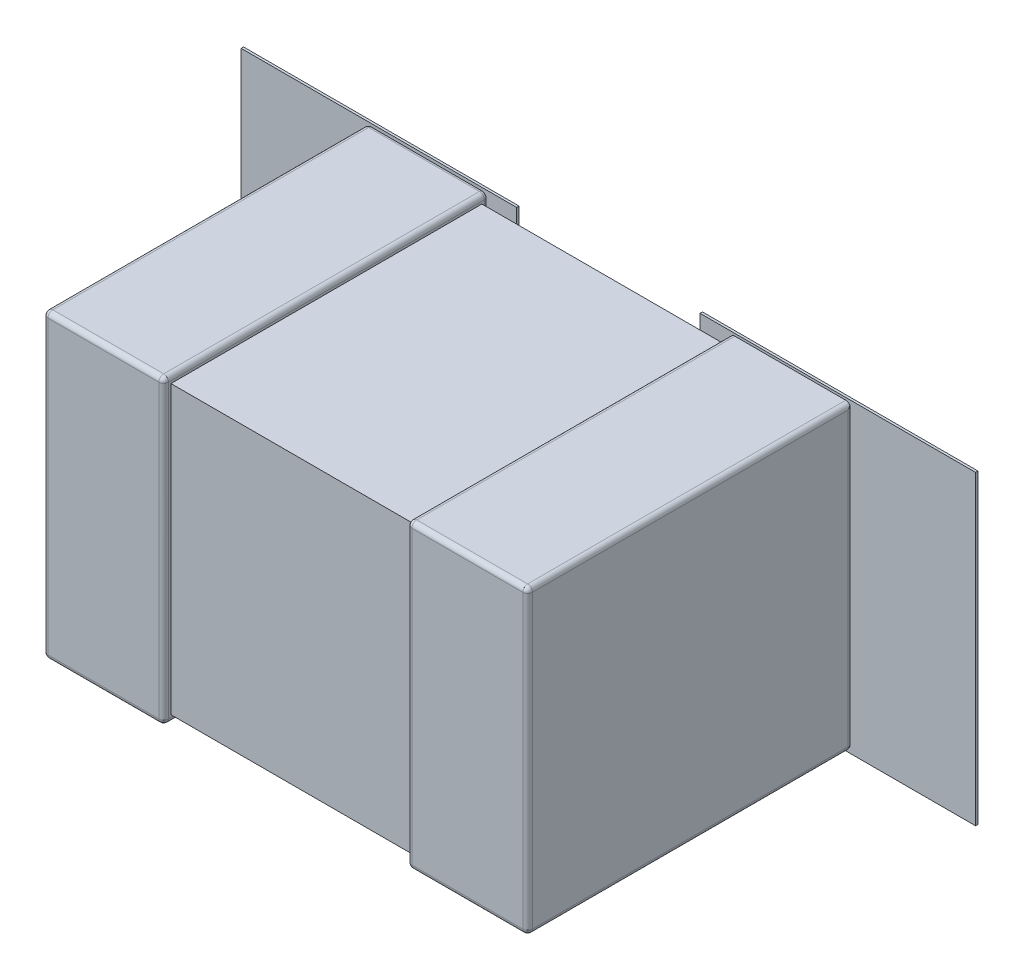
ISO-10303-21;
HEADER;
FILE_DESCRIPTION(('STEP AP214'),'2;1');
FILE_NAME('part.step','',(''),(''),'','','');
FILE_SCHEMA(('AUTOMOTIVE_DESIGN { 1 0 10303 214 1 1 1 1 }'));
ENDSEC;
DATA;
#1=APPLICATION_CONTEXT('core data for automotive mechanical design processes');
#2=APPLICATION_PROTOCOL_DEFINITION('international standard','automotive_design',2000,#1);
#3=PRODUCT_CONTEXT('',#1,'mechanical');
#4=PRODUCT('Part','Part','',(#3));
#5=PRODUCT_RELATED_PRODUCT_CATEGORY('part','',(#4));
#6=PRODUCT_DEFINITION_FORMATION('','',#4);
#7=PRODUCT_DEFINITION_CONTEXT('part definition',#1,'design');
#8=PRODUCT_DEFINITION('design','',#6,#7);
#9=PRODUCT_DEFINITION_SHAPE('','',#8);
#10=(LENGTH_UNIT() NAMED_UNIT(*) SI_UNIT(.MILLI.,.METRE.));
#11=(NAMED_UNIT(*) PLANE_ANGLE_UNIT() SI_UNIT($,.RADIAN.));
#12=(NAMED_UNIT(*) SI_UNIT($,.STERADIAN.) SOLID_ANGLE_UNIT());
#13=UNCERTAINTY_MEASURE_WITH_UNIT(LENGTH_MEASURE(1.E-05),#10,'distance_accuracy_value','');
#14=(GEOMETRIC_REPRESENTATION_CONTEXT(3) GLOBAL_UNCERTAINTY_ASSIGNED_CONTEXT((#13)) GLOBAL_UNIT_ASSIGNED_CONTEXT((#10,
#11,#12)) REPRESENTATION_CONTEXT('',''));
#15=CARTESIAN_POINT('',(0.,0.,0.));
#16=DIRECTION('',(0.,0.,1.));
#17=DIRECTION('',(1.,0.,0.));
#18=AXIS2_PLACEMENT_3D('',#15,#16,#17);
#19=CARTESIAN_POINT('',(0.,0.,0.0762));
#20=DIRECTION('',(0.,0.,1.));
#21=DIRECTION('',(1.,0.,0.));
#22=AXIS2_PLACEMENT_3D('',#19,#20,#21);
#23=PLANE('',#22);
#24=DIRECTION('',(1.,0.,0.));
#25=VECTOR('',#24,1.);
#26=CARTESIAN_POINT('',(-1.5235,-0.635,0.0762));
#27=LINE('',#26,#25);
#28=CARTESIAN_POINT('',(-1.5235,-0.635,0.0762));
#29=VERTEX_POINT('',#28);
#30=CARTESIAN_POINT('',(-0.380500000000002,-0.635,0.0762));
#31=VERTEX_POINT('',#30);
#32=EDGE_CURVE('E917',#29,#31,#27,.T.);
#33=ORIENTED_EDGE('',*,*,#32,.F.);
#34=DIRECTION('',(0.,1.,0.));
#35=VECTOR('',#34,1.);
#36=CARTESIAN_POINT('',(-1.5235,0.635,0.0762));
#37=LINE('',#36,#35);
#38=CARTESIAN_POINT('',(-1.5235,0.635,0.0762));
#39=VERTEX_POINT('',#38);
#40=EDGE_CURVE('E86',#39,#29,#37,.F.);
#41=ORIENTED_EDGE('',*,*,#40,.F.);
#42=DIRECTION('',(1.,0.,0.));
#43=VECTOR('',#42,1.);
#44=CARTESIAN_POINT('',(-0.380500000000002,0.635,0.0762));
#45=LINE('',#44,#43);
#46=CARTESIAN_POINT('',(-0.380500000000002,0.635,0.0762));
#47=VERTEX_POINT('',#46);
#48=EDGE_CURVE('E415',#47,#39,#45,.F.);
#49=ORIENTED_EDGE('',*,*,#48,.F.);
#50=DIRECTION('',(0.,1.,0.));
#51=VECTOR('',#50,1.);
#52=CARTESIAN_POINT('',(-0.380500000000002,-0.635,0.0762));
#53=LINE('',#52,#51);
#54=EDGE_CURVE('E924',#31,#47,#53,.T.);
#55=ORIENTED_EDGE('',*,*,#54,.F.);
#56=EDGE_LOOP('',(#33,#41,#49,#55));
#57=FACE_BOUND('',#56,.T.);
#58=ADVANCED_FACE('F16',(#57),#23,.F.);
#59=CARTESIAN_POINT('',(-0.98495100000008,0.60496700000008,1.40621000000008));
#60=DIRECTION('',(-0.707106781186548,0.,0.707106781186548));
#61=DIRECTION('',(0.,1.,0.));
#62=AXIS2_PLACEMENT_3D('',#59,#60,#61);
#63=SPHERICAL_SURFACE('',#62,0.0199999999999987);
#64=CARTESIAN_POINT('',(-0.98495100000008,0.60496700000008,1.40621000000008));
#65=DIRECTION('',(0.,-1.,0.));
#66=DIRECTION('',(0.,0.,-1.));
#67=AXIS2_PLACEMENT_3D('',#64,#65,#66);
#68=CIRCLE('',#67,0.0199999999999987);
#69=CARTESIAN_POINT('',(-0.98495100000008,0.60496700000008,1.42621000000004));
#70=VERTEX_POINT('',#69);
#71=CARTESIAN_POINT('',(-0.99909313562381,0.60496700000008,1.42035213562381));
#72=VERTEX_POINT('',#71);
#73=EDGE_CURVE('E248',#70,#72,#68,.T.);
#74=ORIENTED_EDGE('',*,*,#73,.F.);
#75=CARTESIAN_POINT('',(-0.98495100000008,0.60496700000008,1.40621000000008));
#76=DIRECTION('',(-1.,0.,0.));
#77=DIRECTION('',(0.,0.,1.));
#78=AXIS2_PLACEMENT_3D('',#75,#76,#77);
#79=CIRCLE('',#78,0.0199999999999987);
#80=CARTESIAN_POINT('',(-0.98495100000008,0.624967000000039,1.40621000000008));
#81=VERTEX_POINT('',#80);
#82=EDGE_CURVE('E251',#81,#70,#79,.F.);
#83=ORIENTED_EDGE('',*,*,#82,.F.);
#84=CARTESIAN_POINT('',(-0.98495100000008,0.60496700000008,1.40621000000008));
#85=DIRECTION('',(0.,0.,-1.));
#86=DIRECTION('',(-1.,0.,0.));
#87=AXIS2_PLACEMENT_3D('',#84,#85,#86);
#88=CIRCLE('',#87,0.0199999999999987);
#89=CARTESIAN_POINT('',(-1.00495100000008,0.60496700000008,1.40621000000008));
#90=VERTEX_POINT('',#89);
#91=EDGE_CURVE('E19',#90,#81,#88,.T.);
#92=ORIENTED_EDGE('',*,*,#91,.F.);
#93=CARTESIAN_POINT('',(-0.98495100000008,0.60496700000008,1.40621000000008));
#94=DIRECTION('',(0.,-1.,0.));
#95=DIRECTION('',(0.,0.,-1.));
#96=AXIS2_PLACEMENT_3D('',#93,#94,#95);
#97=CIRCLE('',#96,0.0199999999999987);
#98=EDGE_CURVE('E253',#72,#90,#97,.T.);
#99=ORIENTED_EDGE('',*,*,#98,.F.);
#100=EDGE_LOOP('',(#74,#83,#92,#99));
#101=FACE_BOUND('',#100,.T.);
#102=ADVANCED_FACE('F250',(#101),#63,.T.);
#103=CARTESIAN_POINT('',(-1.004951,0.624967,0.0762));
#104=DIRECTION('',(-1.,0.,0.));
#105=DIRECTION('',(0.,0.,1.));
#106=AXIS2_PLACEMENT_3D('',#103,#104,#105);
#107=PLANE('',#106);
#108=DIRECTION('',(0.,1.,0.));
#109=VECTOR('',#108,1.);
#110=CARTESIAN_POINT('',(-1.00495100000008,-2.43846719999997,0.0961999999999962));
#111=LINE('',#110,#109);
#112=CARTESIAN_POINT('',(-1.00495100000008,-0.60496700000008,0.0961999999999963));
#113=VERTEX_POINT('',#112);
#114=CARTESIAN_POINT('',(-1.00495100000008,0.60496700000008,0.0961999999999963));
#115=VERTEX_POINT('',#114);
#116=EDGE_CURVE('E414',#113,#115,#111,.T.);
#117=ORIENTED_EDGE('',*,*,#116,.F.);
#118=DIRECTION('',(0.,0.,-1.));
#119=VECTOR('',#118,1.);
#120=CARTESIAN_POINT('',(-1.00495100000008,-0.60496700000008,3.186083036));
#121=LINE('',#120,#119);
#122=CARTESIAN_POINT('',(-1.00495100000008,-0.60496700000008,1.40621000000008));
#123=VERTEX_POINT('',#122);
#124=EDGE_CURVE('E457',#123,#113,#121,.T.);
#125=ORIENTED_EDGE('',*,*,#124,.F.);
#126=DIRECTION('',(0.,-1.,0.));
#127=VECTOR('',#126,1.);
#128=CARTESIAN_POINT('',(-1.00495100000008,2.43846719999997,1.40621000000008));
#129=LINE('',#128,#127);
#130=EDGE_CURVE('E453',#90,#123,#129,.T.);
#131=ORIENTED_EDGE('',*,*,#130,.F.);
#132=DIRECTION('',(0.,0.,-1.));
#133=VECTOR('',#132,1.);
#134=CARTESIAN_POINT('',(-1.00495100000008,0.60496700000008,3.186083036));
#135=LINE('',#134,#133);
#136=EDGE_CURVE('E765',#115,#90,#135,.F.);
#137=ORIENTED_EDGE('',*,*,#136,.F.);
#138=EDGE_LOOP('',(#117,#125,#131,#137));
#139=FACE_BOUND('',#138,.T.);
#140=ADVANCED_FACE('F447',(#139),#107,.T.);
#141=CARTESIAN_POINT('',(-0.98495100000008,-0.60496700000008,1.40621000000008));
#142=DIRECTION('',(-0.707106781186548,-0.707106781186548,0.));
#143=DIRECTION('',(0.,0.,1.));
#144=AXIS2_PLACEMENT_3D('',#141,#142,#143);
#145=SPHERICAL_SURFACE('',#144,0.0199999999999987);
#146=CARTESIAN_POINT('',(-0.98495100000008,-0.60496700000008,1.40621000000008));
#147=DIRECTION('',(0.,0.,-1.));
#148=DIRECTION('',(-1.,0.,0.));
#149=AXIS2_PLACEMENT_3D('',#146,#147,#148);
#150=CIRCLE('',#149,0.0199999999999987);
#151=CARTESIAN_POINT('',(-0.99909313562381,-0.61910913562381,1.40621000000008));
#152=VERTEX_POINT('',#151);
#153=EDGE_CURVE('E34',#152,#123,#150,.T.);
#154=ORIENTED_EDGE('',*,*,#153,.F.);
#155=CARTESIAN_POINT('',(-0.98495100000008,-0.60496700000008,1.40621000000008));
#156=DIRECTION('',(0.,0.,-1.));
#157=DIRECTION('',(-1.,0.,0.));
#158=AXIS2_PLACEMENT_3D('',#155,#156,#157);
#159=CIRCLE('',#158,0.0199999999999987);
#160=CARTESIAN_POINT('',(-0.98495100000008,-0.624967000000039,1.40621000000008));
#161=VERTEX_POINT('',#160);
#162=EDGE_CURVE('E405',#161,#152,#159,.T.);
#163=ORIENTED_EDGE('',*,*,#162,.F.);
#164=CARTESIAN_POINT('',(-0.98495100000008,-0.60496700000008,1.40621000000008));
#165=DIRECTION('',(1.,0.,0.));
#166=DIRECTION('',(0.,0.,-1.));
#167=AXIS2_PLACEMENT_3D('',#164,#165,#166);
#168=CIRCLE('',#167,0.0199999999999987);
#169=CARTESIAN_POINT('',(-0.98495100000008,-0.60496700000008,1.42621000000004));
#170=VERTEX_POINT('',#169);
#171=EDGE_CURVE('E674',#170,#161,#168,.T.);
#172=ORIENTED_EDGE('',*,*,#171,.F.);
#173=CARTESIAN_POINT('',(-0.98495100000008,-0.60496700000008,1.40621000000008));
#174=DIRECTION('',(0.,-1.,0.));
#175=DIRECTION('',(0.,0.,-1.));
#176=AXIS2_PLACEMENT_3D('',#173,#174,#175);
#177=CIRCLE('',#176,0.0199999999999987);
#178=EDGE_CURVE('E271',#123,#170,#177,.F.);
#179=ORIENTED_EDGE('',*,*,#178,.F.);
#180=EDGE_LOOP('',(#154,#163,#172,#179));
#181=FACE_BOUND('',#180,.T.);
#182=ADVANCED_FACE('F442',(#181),#145,.T.);
#183=CARTESIAN_POINT('',(-0.98495100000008,0.60496700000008,3.186083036));
#184=DIRECTION('',(0.,0.,-1.));
#185=DIRECTION('',(-1.,0.,0.));
#186=AXIS2_PLACEMENT_3D('',#183,#184,#185);
#187=CYLINDRICAL_SURFACE('',#186,0.0199999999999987);
#188=ORIENTED_EDGE('',*,*,#91,.T.);
#189=DIRECTION('',(0.,0.,1.));
#190=VECTOR('',#189,1.);
#191=CARTESIAN_POINT('',(-0.98495100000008,0.624967,0.0762));
#192=LINE('',#191,#190);
#193=CARTESIAN_POINT('',(-0.98495100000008,0.624967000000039,0.096199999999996));
#194=VERTEX_POINT('',#193);
#195=EDGE_CURVE('E451',#194,#81,#192,.T.);
#196=ORIENTED_EDGE('',*,*,#195,.F.);
#197=CARTESIAN_POINT('',(-0.98495100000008,0.60496700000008,0.0961999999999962));
#198=DIRECTION('',(0.,0.,-1.));
#199=DIRECTION('',(-0.707106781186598,0.707106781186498,0.));
#200=AXIS2_PLACEMENT_3D('',#197,#198,#199);
#201=CIRCLE('',#200,0.0199999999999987);
#202=CARTESIAN_POINT('',(-0.999093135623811,0.619109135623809,0.0961999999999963));
#203=VERTEX_POINT('',#202);
#204=EDGE_CURVE('E407',#203,#194,#201,.T.);
#205=ORIENTED_EDGE('',*,*,#204,.F.);
#206=CARTESIAN_POINT('',(-0.98495100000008,0.60496700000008,0.0961999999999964));
#207=DIRECTION('',(0.,0.,-1.));
#208=DIRECTION('',(-1.,0.,0.));
#209=AXIS2_PLACEMENT_3D('',#206,#207,#208);
#210=CIRCLE('',#209,0.0199999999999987);
#211=EDGE_CURVE('E410',#115,#203,#210,.T.);
#212=ORIENTED_EDGE('',*,*,#211,.F.);
#213=ORIENTED_EDGE('',*,*,#136,.T.);
#214=EDGE_LOOP('',(#188,#196,#205,#212,#213));
#215=FACE_BOUND('',#214,.T.);
#216=ADVANCED_FACE('F439',(#215),#187,.T.);
#217=CARTESIAN_POINT('',(-1.5235,0.635,0.0762));
#218=DIRECTION('',(-1.,0.,0.));
#219=DIRECTION('',(0.,0.,1.));
#220=AXIS2_PLACEMENT_3D('',#217,#218,#219);
#221=PLANE('',#220);
#222=DIRECTION('',(0.,0.,1.));
#223=VECTOR('',#222,1.);
#224=CARTESIAN_POINT('',(-1.5235,0.635,0.0762));
#225=LINE('',#224,#223);
#226=CARTESIAN_POINT('',(-1.5235,0.635,0.0862000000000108));
#227=VERTEX_POINT('',#226);
#228=EDGE_CURVE('E921',#39,#227,#225,.T.);
#229=ORIENTED_EDGE('',*,*,#228,.F.);
#230=ORIENTED_EDGE('',*,*,#40,.T.);
#231=DIRECTION('',(0.,0.,-1.));
#232=VECTOR('',#231,1.);
#233=CARTESIAN_POINT('',(-1.5235,-0.635,0.0762));
#234=LINE('',#233,#232);
#235=CARTESIAN_POINT('',(-1.5235,-0.635,0.0862000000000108));
#236=VERTEX_POINT('',#235);
#237=EDGE_CURVE('E919',#236,#29,#234,.T.);
#238=ORIENTED_EDGE('',*,*,#237,.F.);
#239=DIRECTION('',(0.,1.,0.));
#240=VECTOR('',#239,1.);
#241=CARTESIAN_POINT('',(-1.5235,0.,0.0862000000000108));
#242=LINE('',#241,#240);
#243=EDGE_CURVE('E350',#227,#236,#242,.F.);
#244=ORIENTED_EDGE('',*,*,#243,.F.);
#245=EDGE_LOOP('',(#229,#230,#238,#244));
#246=FACE_BOUND('',#245,.T.);
#247=ADVANCED_FACE('F435',(#246),#221,.T.);
#248=CARTESIAN_POINT('',(-1.5235,-0.635,0.0762));
#249=DIRECTION('',(0.,-1.,0.));
#250=DIRECTION('',(0.,0.,-1.));
#251=AXIS2_PLACEMENT_3D('',#248,#249,#250);
#252=PLANE('',#251);
#253=ORIENTED_EDGE('',*,*,#237,.T.);
#254=ORIENTED_EDGE('',*,*,#32,.T.);
#255=DIRECTION('',(0.,0.,-1.));
#256=VECTOR('',#255,1.);
#257=CARTESIAN_POINT('',(-0.380500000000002,-0.635,0.0762));
#258=LINE('',#257,#256);
#259=CARTESIAN_POINT('',(-0.380500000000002,-0.635,0.0862000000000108));
#260=VERTEX_POINT('',#259);
#261=EDGE_CURVE('E928',#260,#31,#258,.T.);
#262=ORIENTED_EDGE('',*,*,#261,.F.);
#263=DIRECTION('',(1.,0.,0.));
#264=VECTOR('',#263,1.);
#265=CARTESIAN_POINT('',(0.,-0.635,0.0862000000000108));
#266=LINE('',#265,#264);
#267=EDGE_CURVE('E347',#236,#260,#266,.T.);
#268=ORIENTED_EDGE('',*,*,#267,.F.);
#269=EDGE_LOOP('',(#253,#254,#262,#268));
#270=FACE_BOUND('',#269,.T.);
#271=ADVANCED_FACE('F431',(#270),#252,.T.);
#272=CARTESIAN_POINT('',(-0.380500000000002,-0.635,0.0762));
#273=DIRECTION('',(1.,0.,0.));
#274=DIRECTION('',(0.,0.,-1.));
#275=AXIS2_PLACEMENT_3D('',#272,#273,#274);
#276=PLANE('',#275);
#277=ORIENTED_EDGE('',*,*,#261,.T.);
#278=ORIENTED_EDGE('',*,*,#54,.T.);
#279=DIRECTION('',(0.,0.,1.));
#280=VECTOR('',#279,1.);
#281=CARTESIAN_POINT('',(-0.380500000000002,0.635,0.0762));
#282=LINE('',#281,#280);
#283=CARTESIAN_POINT('',(-0.380500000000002,0.635,0.0862000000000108));
#284=VERTEX_POINT('',#283);
#285=EDGE_CURVE('E923',#284,#47,#282,.F.);
#286=ORIENTED_EDGE('',*,*,#285,.F.);
#287=DIRECTION('',(0.,1.,0.));
#288=VECTOR('',#287,1.);
#289=CARTESIAN_POINT('',(-0.380500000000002,0.,0.0862000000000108));
#290=LINE('',#289,#288);
#291=EDGE_CURVE('E344',#260,#284,#290,.T.);
#292=ORIENTED_EDGE('',*,*,#291,.F.);
#293=EDGE_LOOP('',(#277,#278,#286,#292));
#294=FACE_BOUND('',#293,.T.);
#295=ADVANCED_FACE('F427',(#294),#276,.T.);
#296=CARTESIAN_POINT('',(-0.380500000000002,0.635,0.0762));
#297=DIRECTION('',(0.,1.,0.));
#298=DIRECTION('',(0.,0.,1.));
#299=AXIS2_PLACEMENT_3D('',#296,#297,#298);
#300=PLANE('',#299);
#301=ORIENTED_EDGE('',*,*,#285,.T.);
#302=ORIENTED_EDGE('',*,*,#48,.T.);
#303=ORIENTED_EDGE('',*,*,#228,.T.);
#304=DIRECTION('',(1.,0.,0.));
#305=VECTOR('',#304,1.);
#306=CARTESIAN_POINT('',(0.,0.635,0.0862000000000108));
#307=LINE('',#306,#305);
#308=EDGE_CURVE('E341',#284,#227,#307,.F.);
#309=ORIENTED_EDGE('',*,*,#308,.F.);
#310=EDGE_LOOP('',(#301,#302,#303,#309));
#311=FACE_BOUND('',#310,.T.);
#312=ADVANCED_FACE('F423',(#311),#300,.T.);
#313=CARTESIAN_POINT('',(-0.98495100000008,-0.60496700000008,0.0961999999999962));
#314=DIRECTION('',(-0.707106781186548,0.,-0.707106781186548));
#315=DIRECTION('',(0.,-1.,0.));
#316=AXIS2_PLACEMENT_3D('',#313,#314,#315);
#317=SPHERICAL_SURFACE('',#316,0.0199999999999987);
#318=CARTESIAN_POINT('',(-0.98495100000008,-0.60496700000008,0.0961999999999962));
#319=DIRECTION('',(0.,1.,0.));
#320=DIRECTION('',(0.,0.,1.));
#321=AXIS2_PLACEMENT_3D('',#318,#319,#320);
#322=CIRCLE('',#321,0.0199999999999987);
#323=CARTESIAN_POINT('',(-1.00227150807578,-0.60496700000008,0.0862000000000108));
#324=VERTEX_POINT('',#323);
#325=EDGE_CURVE('E411',#324,#113,#322,.T.);
#326=ORIENTED_EDGE('',*,*,#325,.F.);
#327=CARTESIAN_POINT('',(-0.98495100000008,-0.622287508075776,0.0862000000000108));
#328=CARTESIAN_POINT('',(-0.986903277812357,-0.622300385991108,0.0862000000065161));
#329=CARTESIAN_POINT('',(-0.988847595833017,-0.621959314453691,0.0862000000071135));
#330=CARTESIAN_POINT('',(-0.992520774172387,-0.620662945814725,0.0862000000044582));
#331=CARTESIAN_POINT('',(-0.994249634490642,-0.619707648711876,0.0862000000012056));
#332=CARTESIAN_POINT('',(-0.997292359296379,-0.617276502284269,0.086199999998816));
#333=CARTESIAN_POINT('',(-0.998606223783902,-0.615800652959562,0.0861999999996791));
#334=CARTESIAN_POINT('',(-1.00066964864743,-0.612495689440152,0.0862000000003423));
#335=CARTESIAN_POINT('',(-1.00141920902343,-0.610666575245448,0.0862000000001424));
#336=CARTESIAN_POINT('',(-1.00213177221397,-0.607521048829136,0.0861999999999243));
#337=CARTESIAN_POINT('',(-1.00227616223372,-0.606243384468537,0.0861999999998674));
#338=CARTESIAN_POINT('',(-1.00227150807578,-0.60496700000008,0.0862000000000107));
#339=B_SPLINE_CURVE_WITH_KNOTS('',3,(#327,#328,#329,#330,#331,#332,#333,#334,#335,#336,#337,
#338),.UNSPECIFIED.,.F.,.F.,(4,2,2,2,2,4),(0.,0.00581573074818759,0.0116314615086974,
0.0174471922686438,0.0232629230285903,0.0270884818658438),.UNSPECIFIED.);
#340=CARTESIAN_POINT('',(-0.98495100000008,-0.62228750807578,0.0862000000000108));
#341=VERTEX_POINT('',#340);
#342=EDGE_CURVE('E337',#341,#324,#339,.T.);
#343=ORIENTED_EDGE('',*,*,#342,.F.);
#344=CARTESIAN_POINT('',(-0.98495100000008,-0.60496700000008,0.0961999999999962));
#345=DIRECTION('',(-1.,0.,0.));
#346=DIRECTION('',(0.,0.,1.));
#347=AXIS2_PLACEMENT_3D('',#344,#345,#346);
#348=CIRCLE('',#347,0.0199999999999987);
#349=CARTESIAN_POINT('',(-0.98495100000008,-0.624967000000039,0.0961999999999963));
#350=VERTEX_POINT('',#349);
#351=EDGE_CURVE('E264',#350,#341,#348,.F.);
#352=ORIENTED_EDGE('',*,*,#351,.F.);
#353=CARTESIAN_POINT('',(-0.98495100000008,-0.60496700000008,0.0961999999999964));
#354=DIRECTION('',(0.,0.,-1.));
#355=DIRECTION('',(-1.,0.,0.));
#356=AXIS2_PLACEMENT_3D('',#353,#354,#355);
#357=CIRCLE('',#356,0.0199999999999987);
#358=EDGE_CURVE('E745',#113,#350,#357,.F.);
#359=ORIENTED_EDGE('',*,*,#358,.F.);
#360=EDGE_LOOP('',(#326,#343,#352,#359));
#361=FACE_BOUND('',#360,.T.);
#362=ADVANCED_FACE('F419',(#361),#317,.T.);
#363=CARTESIAN_POINT('',(-0.98495100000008,-2.43846719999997,0.0961999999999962));
#364=DIRECTION('',(0.,1.,0.));
#365=DIRECTION('',(0.,0.,1.));
#366=AXIS2_PLACEMENT_3D('',#363,#364,#365);
#367=CYLINDRICAL_SURFACE('',#366,0.0199999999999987);
#368=CARTESIAN_POINT('',(-0.98495100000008,0.60496700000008,0.0961999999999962));
#369=DIRECTION('',(0.,1.,0.));
#370=DIRECTION('',(0.,0.,1.));
#371=AXIS2_PLACEMENT_3D('',#368,#369,#370);
#372=CIRCLE('',#371,0.0199999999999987);
#373=CARTESIAN_POINT('',(-1.00227150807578,0.60496700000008,0.0862000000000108));
#374=VERTEX_POINT('',#373);
#375=EDGE_CURVE('E757',#374,#115,#372,.T.);
#376=ORIENTED_EDGE('',*,*,#375,.F.);
#377=DIRECTION('',(0.,1.,0.));
#378=VECTOR('',#377,1.);
#379=CARTESIAN_POINT('',(-1.00227150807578,0.,0.0862000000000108));
#380=LINE('',#379,#378);
#381=EDGE_CURVE('E334',#324,#374,#380,.T.);
#382=ORIENTED_EDGE('',*,*,#381,.F.);
#383=ORIENTED_EDGE('',*,*,#325,.T.);
#384=ORIENTED_EDGE('',*,*,#116,.T.);
#385=EDGE_LOOP('',(#376,#382,#383,#384));
#386=FACE_BOUND('',#385,.T.);
#387=ADVANCED_FACE('F399',(#386),#367,.T.);
#388=CARTESIAN_POINT('',(-0.98495100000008,0.60496700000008,0.0961999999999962));
#389=DIRECTION('',(-0.707106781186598,0.707106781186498,0.));
#390=DIRECTION('',(0.,0.,-1.));
#391=AXIS2_PLACEMENT_3D('',#388,#389,#390);
#392=SPHERICAL_SURFACE('',#391,0.0199999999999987);
#393=CARTESIAN_POINT('',(-0.98495100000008,0.60496700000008,0.0961999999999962));
#394=DIRECTION('',(1.,0.,0.));
#395=DIRECTION('',(0.,0.,-1.));
#396=AXIS2_PLACEMENT_3D('',#393,#394,#395);
#397=CIRCLE('',#396,0.0199999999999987);
#398=CARTESIAN_POINT('',(-0.98495100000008,0.62228750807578,0.0862000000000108));
#399=VERTEX_POINT('',#398);
#400=EDGE_CURVE('E409',#399,#194,#397,.T.);
#401=ORIENTED_EDGE('',*,*,#400,.F.);
#402=CARTESIAN_POINT('',(-1.00227150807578,0.60496700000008,0.0862000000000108));
#403=CARTESIAN_POINT('',(-1.00228438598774,0.60691927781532,0.0862000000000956));
#404=CARTESIAN_POINT('',(-1.00194331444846,0.608863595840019,0.0862000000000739));
#405=CARTESIAN_POINT('',(-1.00064694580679,0.612536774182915,0.0862000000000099));
#406=CARTESIAN_POINT('',(-0.999691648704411,0.614265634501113,0.0861999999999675));
#407=CARTESIAN_POINT('',(-0.99726050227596,0.617308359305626,0.0862000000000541));
#408=CARTESIAN_POINT('',(-0.995784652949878,0.618622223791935,0.086200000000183));
#409=CARTESIAN_POINT('',(-0.992479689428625,0.620685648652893,0.0862000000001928));
#410=CARTESIAN_POINT('',(-0.990650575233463,0.621435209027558,0.0862000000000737));
#411=CARTESIAN_POINT('',(-0.987505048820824,0.622147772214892,0.0861999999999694));
#412=CARTESIAN_POINT('',(-0.986227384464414,0.622292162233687,0.0861999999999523));
#413=CARTESIAN_POINT('',(-0.98495100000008,0.622287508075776,0.0862000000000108));
#414=B_SPLINE_CURVE_WITH_KNOTS('',3,(#402,#403,#404,#405,#406,#407,#408,#409,#410,#411,#412,
#413),.UNSPECIFIED.,.F.,.F.,(4,2,2,2,2,4),(0.,0.00581573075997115,0.0116314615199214,
0.0174471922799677,0.0232629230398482,0.0270884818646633),.UNSPECIFIED.);
#415=EDGE_CURVE('E333',#374,#399,#414,.T.);
#416=ORIENTED_EDGE('',*,*,#415,.F.);
#417=ORIENTED_EDGE('',*,*,#375,.T.);
#418=ORIENTED_EDGE('',*,*,#211,.T.);
#419=ORIENTED_EDGE('',*,*,#204,.T.);
#420=EDGE_LOOP('',(#401,#416,#417,#418,#419));
#421=FACE_BOUND('',#420,.T.);
#422=ADVANCED_FACE('F392',(#421),#392,.T.);
#423=CARTESIAN_POINT('',(-5.4955692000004,0.60496700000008,0.0961999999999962));
#424=DIRECTION('',(1.,0.,0.));
#425=DIRECTION('',(0.,0.,-1.));
#426=AXIS2_PLACEMENT_3D('',#423,#424,#425);
#427=CYLINDRICAL_SURFACE('',#426,0.0199999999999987);
#428=CARTESIAN_POINT('',(-0.524950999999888,0.60496700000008,0.0961999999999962));
#429=DIRECTION('',(1.,0.,0.));
#430=DIRECTION('',(0.,0.,-1.));
#431=AXIS2_PLACEMENT_3D('',#428,#429,#430);
#432=CIRCLE('',#431,0.0199999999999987);
#433=CARTESIAN_POINT('',(-0.524950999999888,0.62228750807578,0.0862000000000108));
#434=VERTEX_POINT('',#433);
#435=CARTESIAN_POINT('',(-0.524950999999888,0.624967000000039,0.0961999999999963));
#436=VERTEX_POINT('',#435);
#437=EDGE_CURVE('E353',#434,#436,#432,.T.);
#438=ORIENTED_EDGE('',*,*,#437,.F.);
#439=DIRECTION('',(1.,0.,0.));
#440=VECTOR('',#439,1.);
#441=CARTESIAN_POINT('',(0.,0.622287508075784,0.0862000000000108));
#442=LINE('',#441,#440);
#443=EDGE_CURVE('E329',#399,#434,#442,.T.);
#444=ORIENTED_EDGE('',*,*,#443,.F.);
#445=ORIENTED_EDGE('',*,*,#400,.T.);
#446=DIRECTION('',(1.,0.,0.));
#447=VECTOR('',#446,1.);
#448=CARTESIAN_POINT('',(1.004951,0.624967,0.0961999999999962));
#449=LINE('',#448,#447);
#450=EDGE_CURVE('E673',#436,#194,#449,.F.);
#451=ORIENTED_EDGE('',*,*,#450,.F.);
#452=EDGE_LOOP('',(#438,#444,#445,#451));
#453=FACE_BOUND('',#452,.T.);
#454=ADVANCED_FACE('F398',(#453),#427,.T.);
#455=CARTESIAN_POINT('',(-0.98495100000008,-0.60496700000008,3.186083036));
#456=DIRECTION('',(0.,0.,-1.));
#457=DIRECTION('',(-1.,0.,0.));
#458=AXIS2_PLACEMENT_3D('',#455,#456,#457);
#459=CYLINDRICAL_SURFACE('',#458,0.0199999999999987);
#460=ORIENTED_EDGE('',*,*,#153,.T.);
#461=ORIENTED_EDGE('',*,*,#124,.T.);
#462=ORIENTED_EDGE('',*,*,#358,.T.);
#463=DIRECTION('',(0.,0.,-1.));
#464=VECTOR('',#463,1.);
#465=CARTESIAN_POINT('',(-0.98495100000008,-0.624967,0.0762));
#466=LINE('',#465,#464);
#467=EDGE_CURVE('E323',#161,#350,#466,.T.);
#468=ORIENTED_EDGE('',*,*,#467,.F.);
#469=ORIENTED_EDGE('',*,*,#162,.T.);
#470=EDGE_LOOP('',(#460,#461,#462,#468,#469));
#471=FACE_BOUND('',#470,.T.);
#472=ADVANCED_FACE('F742',(#471),#459,.T.);
#473=CARTESIAN_POINT('',(5.4955692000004,-0.60496700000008,0.0961999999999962));
#474=DIRECTION('',(-1.,0.,0.));
#475=DIRECTION('',(0.,0.,1.));
#476=AXIS2_PLACEMENT_3D('',#473,#474,#475);
#477=CYLINDRICAL_SURFACE('',#476,0.0199999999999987);
#478=ORIENTED_EDGE('',*,*,#351,.T.);
#479=DIRECTION('',(1.,0.,0.));
#480=VECTOR('',#479,1.);
#481=CARTESIAN_POINT('',(0.,-0.622287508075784,0.0862000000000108));
#482=LINE('',#481,#480);
#483=CARTESIAN_POINT('',(-0.524950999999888,-0.62228750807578,0.0862000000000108));
#484=VERTEX_POINT('',#483);
#485=EDGE_CURVE('E338',#484,#341,#482,.F.);
#486=ORIENTED_EDGE('',*,*,#485,.F.);
#487=CARTESIAN_POINT('',(-0.524950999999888,-0.60496700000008,0.0961999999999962));
#488=DIRECTION('',(-1.,0.,0.));
#489=DIRECTION('',(0.,0.,1.));
#490=AXIS2_PLACEMENT_3D('',#487,#488,#489);
#491=CIRCLE('',#490,0.0199999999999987);
#492=CARTESIAN_POINT('',(-0.524950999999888,-0.624967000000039,0.0961999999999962));
#493=VERTEX_POINT('',#492);
#494=EDGE_CURVE('E380',#493,#484,#491,.F.);
#495=ORIENTED_EDGE('',*,*,#494,.F.);
#496=DIRECTION('',(1.,0.,0.));
#497=VECTOR('',#496,1.);
#498=CARTESIAN_POINT('',(-1.004951,-0.624967,0.0961999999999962));
#499=LINE('',#498,#497);
#500=EDGE_CURVE('E320',#350,#493,#499,.T.);
#501=ORIENTED_EDGE('',*,*,#500,.F.);
#502=EDGE_LOOP('',(#478,#486,#495,#501));
#503=FACE_BOUND('',#502,.T.);
#504=ADVANCED_FACE('F697',(#503),#477,.T.);
#505=CARTESIAN_POINT('',(5.4955692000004,0.60496700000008,1.40621000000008));
#506=DIRECTION('',(-1.,0.,0.));
#507=DIRECTION('',(0.,0.,1.));
#508=AXIS2_PLACEMENT_3D('',#505,#506,#507);
#509=CYLINDRICAL_SURFACE('',#508,0.0199999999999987);
#510=ORIENTED_EDGE('',*,*,#82,.T.);
#511=DIRECTION('',(1.,0.,0.));
#512=VECTOR('',#511,1.);
#513=CARTESIAN_POINT('',(0.,0.60496700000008,1.42621));
#514=LINE('',#513,#512);
#515=CARTESIAN_POINT('',(-0.524950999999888,0.60496700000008,1.42621000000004));
#516=VERTEX_POINT('',#515);
#517=EDGE_CURVE('E260',#516,#70,#514,.F.);
#518=ORIENTED_EDGE('',*,*,#517,.F.);
#519=CARTESIAN_POINT('',(-0.524950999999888,0.60496700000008,1.40621000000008));
#520=DIRECTION('',(-1.,0.,0.));
#521=DIRECTION('',(0.,0.,1.));
#522=AXIS2_PLACEMENT_3D('',#519,#520,#521);
#523=CIRCLE('',#522,0.0199999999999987);
#524=CARTESIAN_POINT('',(-0.524950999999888,0.624967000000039,1.40621000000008));
#525=VERTEX_POINT('',#524);
#526=EDGE_CURVE('E282',#525,#516,#523,.F.);
#527=ORIENTED_EDGE('',*,*,#526,.F.);
#528=DIRECTION('',(1.,0.,0.));
#529=VECTOR('',#528,1.);
#530=CARTESIAN_POINT('',(1.004951,0.624967,1.40621000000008));
#531=LINE('',#530,#529);
#532=EDGE_CURVE('E263',#81,#525,#531,.T.);
#533=ORIENTED_EDGE('',*,*,#532,.F.);
#534=EDGE_LOOP('',(#510,#518,#527,#533));
#535=FACE_BOUND('',#534,.T.);
#536=ADVANCED_FACE('F258',(#535),#509,.T.);
#537=CARTESIAN_POINT('',(-0.98495100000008,2.43846719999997,1.40621000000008));
#538=DIRECTION('',(0.,-1.,0.));
#539=DIRECTION('',(0.,0.,-1.));
#540=AXIS2_PLACEMENT_3D('',#537,#538,#539);
#541=CYLINDRICAL_SURFACE('',#540,0.0199999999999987);
#542=ORIENTED_EDGE('',*,*,#178,.T.);
#543=DIRECTION('',(0.,1.,0.));
#544=VECTOR('',#543,1.);
#545=CARTESIAN_POINT('',(-0.98495100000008,0.,1.42621));
#546=LINE('',#545,#544);
#547=EDGE_CURVE('E268',#70,#170,#546,.F.);
#548=ORIENTED_EDGE('',*,*,#547,.F.);
#549=ORIENTED_EDGE('',*,*,#73,.T.);
#550=ORIENTED_EDGE('',*,*,#98,.T.);
#551=ORIENTED_EDGE('',*,*,#130,.T.);
#552=EDGE_LOOP('',(#542,#548,#549,#550,#551));
#553=FACE_BOUND('',#552,.T.);
#554=ADVANCED_FACE('F269',(#553),#541,.T.);
#555=CARTESIAN_POINT('',(-5.4955692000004,-0.60496700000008,1.40621000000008));
#556=DIRECTION('',(1.,0.,0.));
#557=DIRECTION('',(0.,0.,-1.));
#558=AXIS2_PLACEMENT_3D('',#555,#556,#557);
#559=CYLINDRICAL_SURFACE('',#558,0.0199999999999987);
#560=ORIENTED_EDGE('',*,*,#171,.T.);
#561=DIRECTION('',(1.,0.,0.));
#562=VECTOR('',#561,1.);
#563=CARTESIAN_POINT('',(-1.004951,-0.624967,1.40621000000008));
#564=LINE('',#563,#562);
#565=CARTESIAN_POINT('',(-0.524950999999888,-0.624967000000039,1.40621000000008));
#566=VERTEX_POINT('',#565);
#567=EDGE_CURVE('E318',#566,#161,#564,.F.);
#568=ORIENTED_EDGE('',*,*,#567,.F.);
#569=CARTESIAN_POINT('',(-0.524950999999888,-0.60496700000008,1.40621000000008));
#570=DIRECTION('',(1.,0.,0.));
#571=DIRECTION('',(0.,0.,-1.));
#572=AXIS2_PLACEMENT_3D('',#569,#570,#571);
#573=CIRCLE('',#572,0.0199999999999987);
#574=CARTESIAN_POINT('',(-0.524950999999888,-0.60496700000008,1.42621000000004));
#575=VERTEX_POINT('',#574);
#576=EDGE_CURVE('E284',#575,#566,#573,.T.);
#577=ORIENTED_EDGE('',*,*,#576,.F.);
#578=DIRECTION('',(1.,0.,0.));
#579=VECTOR('',#578,1.);
#580=CARTESIAN_POINT('',(0.,-0.60496700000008,1.42621));
#581=LINE('',#580,#579);
#582=EDGE_CURVE('E275',#170,#575,#581,.T.);
#583=ORIENTED_EDGE('',*,*,#582,.F.);
#584=EDGE_LOOP('',(#560,#568,#577,#583));
#585=FACE_BOUND('',#584,.T.);
#586=ADVANCED_FACE('F746',(#585),#559,.T.);
#587=CARTESIAN_POINT('',(1.004951,0.624967,0.0762));
#588=DIRECTION('',(0.,1.,0.));
#589=DIRECTION('',(0.,0.,1.));
#590=AXIS2_PLACEMENT_3D('',#587,#588,#589);
#591=PLANE('',#590);
#592=ORIENTED_EDGE('',*,*,#450,.T.);
#593=ORIENTED_EDGE('',*,*,#195,.T.);
#594=ORIENTED_EDGE('',*,*,#532,.T.);
#595=DIRECTION('',(0.,0.,-1.));
#596=VECTOR('',#595,1.);
#597=CARTESIAN_POINT('',(-0.524950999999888,0.624967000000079,3.186083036));
#598=LINE('',#597,#596);
#599=EDGE_CURVE('E362',#436,#525,#598,.F.);
#600=ORIENTED_EDGE('',*,*,#599,.F.);
#601=EDGE_LOOP('',(#592,#593,#594,#600));
#602=FACE_BOUND('',#601,.T.);
#603=ADVANCED_FACE('F370',(#602),#591,.T.);
#604=CARTESIAN_POINT('',(-0.524950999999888,0.60496700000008,0.0961999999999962));
#605=DIRECTION('',(0.707106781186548,0.,-0.707106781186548));
#606=DIRECTION('',(0.,1.,0.));
#607=AXIS2_PLACEMENT_3D('',#604,#605,#606);
#608=SPHERICAL_SURFACE('',#607,0.0199999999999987);
#609=CARTESIAN_POINT('',(-0.524950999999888,0.60496700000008,0.0961999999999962));
#610=DIRECTION('',(0.,-1.,0.));
#611=DIRECTION('',(0.,0.,-1.));
#612=AXIS2_PLACEMENT_3D('',#609,#610,#611);
#613=CIRCLE('',#612,0.0199999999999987);
#614=CARTESIAN_POINT('',(-0.507630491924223,0.60496700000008,0.0861999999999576));
#615=VERTEX_POINT('',#614);
#616=CARTESIAN_POINT('',(-0.504950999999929,0.60496700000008,0.0961999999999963));
#617=VERTEX_POINT('',#616);
#618=EDGE_CURVE('E359',#615,#617,#613,.T.);
#619=ORIENTED_EDGE('',*,*,#618,.F.);
#620=CARTESIAN_POINT('',(-0.524950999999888,0.622287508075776,0.0862000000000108));
#621=CARTESIAN_POINT('',(-0.522998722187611,0.622300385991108,0.0862000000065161));
#622=CARTESIAN_POINT('',(-0.521054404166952,0.621959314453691,0.0862000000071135));
#623=CARTESIAN_POINT('',(-0.517381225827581,0.620662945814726,0.0862000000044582));
#624=CARTESIAN_POINT('',(-0.515652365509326,0.619707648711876,0.0862000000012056));
#625=CARTESIAN_POINT('',(-0.512609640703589,0.617276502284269,0.086199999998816));
#626=CARTESIAN_POINT('',(-0.511295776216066,0.615800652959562,0.0861999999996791));
#627=CARTESIAN_POINT('',(-0.509232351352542,0.612495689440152,0.0862000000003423));
#628=CARTESIAN_POINT('',(-0.508482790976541,0.610666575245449,0.0862000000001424));
#629=CARTESIAN_POINT('',(-0.507770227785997,0.607521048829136,0.0861999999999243));
#630=CARTESIAN_POINT('',(-0.507625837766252,0.606243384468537,0.0861999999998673));
#631=CARTESIAN_POINT('',(-0.507630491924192,0.60496700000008,0.0862000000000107));
#632=B_SPLINE_CURVE_WITH_KNOTS('',3,(#620,#621,#622,#623,#624,#625,#626,#627,#628,#629,#630,
#631),.UNSPECIFIED.,.F.,.F.,(4,2,2,2,2,4),(0.,0.00581573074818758,0.0116314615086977,
0.0174471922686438,0.0232629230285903,0.027088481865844),.UNSPECIFIED.);
#633=EDGE_CURVE('E332',#434,#615,#632,.T.);
#634=ORIENTED_EDGE('',*,*,#633,.F.);
#635=ORIENTED_EDGE('',*,*,#437,.T.);
#636=CARTESIAN_POINT('',(-0.524950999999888,0.60496700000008,0.0961999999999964));
#637=DIRECTION('',(0.,0.,-1.));
#638=DIRECTION('',(-1.,0.,0.));
#639=AXIS2_PLACEMENT_3D('',#636,#637,#638);
#640=CIRCLE('',#639,0.0199999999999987);
#641=EDGE_CURVE('E677',#617,#436,#640,.F.);
#642=ORIENTED_EDGE('',*,*,#641,.F.);
#643=EDGE_LOOP('',(#619,#634,#635,#642));
#644=FACE_BOUND('',#643,.T.);
#645=ADVANCED_FACE('F366',(#644),#608,.T.);
#646=CARTESIAN_POINT('',(0.,0.,0.0862000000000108));
#647=DIRECTION('',(0.,0.,1.));
#648=DIRECTION('',(1.,0.,0.));
#649=AXIS2_PLACEMENT_3D('',#646,#647,#648);
#650=PLANE('',#649);
#651=ORIENTED_EDGE('',*,*,#633,.T.);
#652=DIRECTION('',(0.,-1.,0.));
#653=VECTOR('',#652,1.);
#654=CARTESIAN_POINT('',(-0.507630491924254,2.43846719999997,0.0861999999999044));
#655=LINE('',#654,#653);
#656=CARTESIAN_POINT('',(-0.507630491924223,-0.60496700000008,0.0861999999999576));
#657=VERTEX_POINT('',#656);
#658=EDGE_CURVE('E354',#657,#615,#655,.F.);
#659=ORIENTED_EDGE('',*,*,#658,.F.);
#660=CARTESIAN_POINT('',(-0.524950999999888,-0.622287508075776,0.0862000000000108));
#661=CARTESIAN_POINT('',(-0.522998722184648,-0.622300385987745,0.08620000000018));
#662=CARTESIAN_POINT('',(-0.521054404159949,-0.621959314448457,0.0862000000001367));
#663=CARTESIAN_POINT('',(-0.517381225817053,-0.620662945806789,0.0862000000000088));
#664=CARTESIAN_POINT('',(-0.515652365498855,-0.619707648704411,0.0861999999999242));
#665=CARTESIAN_POINT('',(-0.512609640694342,-0.61727650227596,0.0862000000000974));
#666=CARTESIAN_POINT('',(-0.511295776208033,-0.615800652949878,0.0862000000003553));
#667=CARTESIAN_POINT('',(-0.509232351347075,-0.612495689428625,0.0862000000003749));
#668=CARTESIAN_POINT('',(-0.50848279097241,-0.610666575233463,0.0862000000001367));
#669=CARTESIAN_POINT('',(-0.507770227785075,-0.607521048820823,0.086199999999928));
#670=CARTESIAN_POINT('',(-0.507625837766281,-0.606243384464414,0.0861999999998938));
#671=CARTESIAN_POINT('',(-0.507630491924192,-0.60496700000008,0.0862000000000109));
#672=B_SPLINE_CURVE_WITH_KNOTS('',3,(#660,#661,#662,#663,#664,#665,#666,#667,#668,#669,#670,
#671),.UNSPECIFIED.,.F.,.F.,(4,2,2,2,2,4),(0.,0.00581573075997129,0.0116314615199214,
0.0174471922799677,0.0232629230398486,0.0270884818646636),.UNSPECIFIED.);
#673=EDGE_CURVE('E684',#484,#657,#672,.T.);
#674=ORIENTED_EDGE('',*,*,#673,.F.);
#675=ORIENTED_EDGE('',*,*,#485,.T.);
#676=ORIENTED_EDGE('',*,*,#342,.T.);
#677=ORIENTED_EDGE('',*,*,#381,.T.);
#678=ORIENTED_EDGE('',*,*,#415,.T.);
#679=ORIENTED_EDGE('',*,*,#443,.T.);
#680=EDGE_LOOP('',(#651,#659,#674,#675,#676,#677,#678,#679));
#681=FACE_BOUND('',#680,.T.);
#682=ORIENTED_EDGE('',*,*,#291,.T.);
#683=ORIENTED_EDGE('',*,*,#308,.T.);
#684=ORIENTED_EDGE('',*,*,#243,.T.);
#685=ORIENTED_EDGE('',*,*,#267,.T.);
#686=EDGE_LOOP('',(#682,#683,#684,#685));
#687=FACE_BOUND('',#686,.T.);
#688=ADVANCED_FACE('F310',(#681,#687),#650,.T.);
#689=CARTESIAN_POINT('',(-0.524950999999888,-0.60496700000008,0.0961999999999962));
#690=DIRECTION('',(0.707106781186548,-0.707106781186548,0.));
#691=DIRECTION('',(0.,0.,-1.));
#692=AXIS2_PLACEMENT_3D('',#689,#690,#691);
#693=SPHERICAL_SURFACE('',#692,0.0199999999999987);
#694=ORIENTED_EDGE('',*,*,#494,.T.);
#695=ORIENTED_EDGE('',*,*,#673,.T.);
#696=CARTESIAN_POINT('',(-0.524950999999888,-0.60496700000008,0.0961999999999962));
#697=DIRECTION('',(0.,-1.,0.));
#698=DIRECTION('',(0.,0.,-1.));
#699=AXIS2_PLACEMENT_3D('',#696,#697,#698);
#700=CIRCLE('',#699,0.0199999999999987);
#701=CARTESIAN_POINT('',(-0.504950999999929,-0.60496700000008,0.0961999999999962));
#702=VERTEX_POINT('',#701);
#703=EDGE_CURVE('E358',#702,#657,#700,.F.);
#704=ORIENTED_EDGE('',*,*,#703,.F.);
#705=CARTESIAN_POINT('',(-0.524950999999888,-0.60496700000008,0.0961999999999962));
#706=DIRECTION('',(0.,0.,1.));
#707=DIRECTION('',(1.,0.,0.));
#708=AXIS2_PLACEMENT_3D('',#705,#706,#707);
#709=CIRCLE('',#708,0.0199999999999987);
#710=CARTESIAN_POINT('',(-0.510808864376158,-0.61910913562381,0.0961999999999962));
#711=VERTEX_POINT('',#710);
#712=EDGE_CURVE('E706',#711,#702,#709,.T.);
#713=ORIENTED_EDGE('',*,*,#712,.F.);
#714=CARTESIAN_POINT('',(-0.524950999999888,-0.60496700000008,0.0961999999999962));
#715=DIRECTION('',(0.,0.,1.));
#716=DIRECTION('',(1.,0.,0.));
#717=AXIS2_PLACEMENT_3D('',#714,#715,#716);
#718=CIRCLE('',#717,0.0199999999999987);
#719=EDGE_CURVE('E357',#493,#711,#718,.T.);
#720=ORIENTED_EDGE('',*,*,#719,.F.);
#721=EDGE_LOOP('',(#694,#695,#704,#713,#720));
#722=FACE_BOUND('',#721,.T.);
#723=ADVANCED_FACE('F304',(#722),#693,.T.);
#724=CARTESIAN_POINT('',(-1.004951,-0.624967,0.0762));
#725=DIRECTION('',(0.,-1.,0.));
#726=DIRECTION('',(0.,0.,-1.));
#727=AXIS2_PLACEMENT_3D('',#724,#725,#726);
#728=PLANE('',#727);
#729=DIRECTION('',(0.,0.,1.));
#730=VECTOR('',#729,1.);
#731=CARTESIAN_POINT('',(-0.524950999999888,-0.624967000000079,-1.683673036));
#732=LINE('',#731,#730);
#733=EDGE_CURVE('E713',#566,#493,#732,.F.);
#734=ORIENTED_EDGE('',*,*,#733,.F.);
#735=ORIENTED_EDGE('',*,*,#567,.T.);
#736=ORIENTED_EDGE('',*,*,#467,.T.);
#737=ORIENTED_EDGE('',*,*,#500,.T.);
#738=EDGE_LOOP('',(#734,#735,#736,#737));
#739=FACE_BOUND('',#738,.T.);
#740=ADVANCED_FACE('F298',(#739),#728,.T.);
#741=CARTESIAN_POINT('',(-0.524950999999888,-0.60496700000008,1.40621000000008));
#742=DIRECTION('',(0.707106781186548,0.,0.707106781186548));
#743=DIRECTION('',(0.,-1.,0.));
#744=AXIS2_PLACEMENT_3D('',#741,#742,#743);
#745=SPHERICAL_SURFACE('',#744,0.0199999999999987);
#746=CARTESIAN_POINT('',(-0.524950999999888,-0.60496700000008,1.40621000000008));
#747=DIRECTION('',(0.,1.,0.));
#748=DIRECTION('',(0.,0.,1.));
#749=AXIS2_PLACEMENT_3D('',#746,#747,#748);
#750=CIRCLE('',#749,0.0199999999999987);
#751=CARTESIAN_POINT('',(-0.510808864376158,-0.60496700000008,1.42035213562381));
#752=VERTEX_POINT('',#751);
#753=CARTESIAN_POINT('',(-0.504950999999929,-0.60496700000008,1.40621000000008));
#754=VERTEX_POINT('',#753);
#755=EDGE_CURVE('E726',#752,#754,#750,.T.);
#756=ORIENTED_EDGE('',*,*,#755,.F.);
#757=CARTESIAN_POINT('',(-0.524950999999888,-0.60496700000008,1.40621000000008));
#758=DIRECTION('',(0.,1.,0.));
#759=DIRECTION('',(0.,0.,1.));
#760=AXIS2_PLACEMENT_3D('',#757,#758,#759);
#761=CIRCLE('',#760,0.0199999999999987);
#762=EDGE_CURVE('E716',#575,#752,#761,.T.);
#763=ORIENTED_EDGE('',*,*,#762,.F.);
#764=ORIENTED_EDGE('',*,*,#576,.T.);
#765=CARTESIAN_POINT('',(-0.524950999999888,-0.60496700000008,1.40621000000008));
#766=DIRECTION('',(0.,0.,1.));
#767=DIRECTION('',(1.,0.,0.));
#768=AXIS2_PLACEMENT_3D('',#765,#766,#767);
#769=CIRCLE('',#768,0.0199999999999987);
#770=EDGE_CURVE('E709',#754,#566,#769,.F.);
#771=ORIENTED_EDGE('',*,*,#770,.F.);
#772=EDGE_LOOP('',(#756,#763,#764,#771));
#773=FACE_BOUND('',#772,.T.);
#774=ADVANCED_FACE('F293',(#773),#745,.T.);
#775=CARTESIAN_POINT('',(-0.524950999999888,0.60496700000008,1.40621000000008));
#776=DIRECTION('',(0.707106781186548,0.707106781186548,0.));
#777=DIRECTION('',(0.,0.,1.));
#778=AXIS2_PLACEMENT_3D('',#775,#776,#777);
#779=SPHERICAL_SURFACE('',#778,0.0199999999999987);
#780=CARTESIAN_POINT('',(-0.524950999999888,0.60496700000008,1.40621000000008));
#781=DIRECTION('',(0.,0.,-1.));
#782=DIRECTION('',(-1.,0.,0.));
#783=AXIS2_PLACEMENT_3D('',#780,#781,#782);
#784=CIRCLE('',#783,0.0199999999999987);
#785=CARTESIAN_POINT('',(-0.510808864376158,0.61910913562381,1.40621000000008));
#786=VERTEX_POINT('',#785);
#787=EDGE_CURVE('E662',#525,#786,#784,.T.);
#788=ORIENTED_EDGE('',*,*,#787,.F.);
#789=ORIENTED_EDGE('',*,*,#526,.T.);
#790=CARTESIAN_POINT('',(-0.524950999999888,0.60496700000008,1.40621000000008));
#791=DIRECTION('',(0.,1.,0.));
#792=DIRECTION('',(0.,0.,1.));
#793=AXIS2_PLACEMENT_3D('',#790,#791,#792);
#794=CIRCLE('',#793,0.0199999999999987);
#795=CARTESIAN_POINT('',(-0.504950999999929,0.60496700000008,1.40621000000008));
#796=VERTEX_POINT('',#795);
#797=EDGE_CURVE('E724',#796,#516,#794,.F.);
#798=ORIENTED_EDGE('',*,*,#797,.F.);
#799=CARTESIAN_POINT('',(-0.524950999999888,0.60496700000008,1.40621000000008));
#800=DIRECTION('',(0.,0.,-1.));
#801=DIRECTION('',(-1.,0.,0.));
#802=AXIS2_PLACEMENT_3D('',#799,#800,#801);
#803=CIRCLE('',#802,0.0199999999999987);
#804=EDGE_CURVE('E664',#786,#796,#803,.T.);
#805=ORIENTED_EDGE('',*,*,#804,.F.);
#806=EDGE_LOOP('',(#788,#789,#798,#805));
#807=FACE_BOUND('',#806,.T.);
#808=ADVANCED_FACE('F297',(#807),#779,.T.);
#809=CARTESIAN_POINT('',(0.,0.,1.42621));
#810=DIRECTION('',(0.,0.,1.));
#811=DIRECTION('',(1.,0.,0.));
#812=AXIS2_PLACEMENT_3D('',#809,#810,#811);
#813=PLANE('',#812);
#814=ORIENTED_EDGE('',*,*,#547,.T.);
#815=ORIENTED_EDGE('',*,*,#582,.T.);
#816=DIRECTION('',(0.,1.,0.));
#817=VECTOR('',#816,1.);
#818=CARTESIAN_POINT('',(-0.524950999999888,-2.43846719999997,1.42621000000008));
#819=LINE('',#818,#817);
#820=EDGE_CURVE('E280',#516,#575,#819,.F.);
#821=ORIENTED_EDGE('',*,*,#820,.F.);
#822=ORIENTED_EDGE('',*,*,#517,.T.);
#823=EDGE_LOOP('',(#814,#815,#821,#822));
#824=FACE_BOUND('',#823,.T.);
#825=ADVANCED_FACE('F278',(#824),#813,.T.);
#826=CARTESIAN_POINT('',(-0.524950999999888,0.60496700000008,3.186083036));
#827=DIRECTION('',(0.,0.,-1.));
#828=DIRECTION('',(-1.,0.,0.));
#829=AXIS2_PLACEMENT_3D('',#826,#827,#828);
#830=CYLINDRICAL_SURFACE('',#829,0.0199999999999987);
#831=ORIENTED_EDGE('',*,*,#641,.T.);
#832=ORIENTED_EDGE('',*,*,#599,.T.);
#833=ORIENTED_EDGE('',*,*,#787,.T.);
#834=ORIENTED_EDGE('',*,*,#804,.T.);
#835=DIRECTION('',(0.,0.,1.));
#836=VECTOR('',#835,1.);
#837=CARTESIAN_POINT('',(-0.504950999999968,0.60496700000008,0.0762));
#838=LINE('',#837,#836);
#839=EDGE_CURVE('E328',#796,#617,#838,.F.);
#840=ORIENTED_EDGE('',*,*,#839,.T.);
#841=EDGE_LOOP('',(#831,#832,#833,#834,#840));
#842=FACE_BOUND('',#841,.T.);
#843=ADVANCED_FACE('F649',(#842),#830,.T.);
#844=CARTESIAN_POINT('',(-0.524950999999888,2.43846719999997,0.0961999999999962));
#845=DIRECTION('',(0.,-1.,0.));
#846=DIRECTION('',(0.,0.,-1.));
#847=AXIS2_PLACEMENT_3D('',#844,#845,#846);
#848=CYLINDRICAL_SURFACE('',#847,0.0199999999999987);
#849=ORIENTED_EDGE('',*,*,#703,.T.);
#850=ORIENTED_EDGE('',*,*,#658,.T.);
#851=ORIENTED_EDGE('',*,*,#618,.T.);
#852=DIRECTION('',(0.,1.,0.));
#853=VECTOR('',#852,1.);
#854=CARTESIAN_POINT('',(-0.504950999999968,-0.624967,0.0961999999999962));
#855=LINE('',#854,#853);
#856=EDGE_CURVE('E324',#617,#702,#855,.F.);
#857=ORIENTED_EDGE('',*,*,#856,.T.);
#858=EDGE_LOOP('',(#849,#850,#851,#857));
#859=FACE_BOUND('',#858,.T.);
#860=ADVANCED_FACE('F645',(#859),#848,.T.);
#861=CARTESIAN_POINT('',(-0.524950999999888,-0.60496700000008,-1.683673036));
#862=DIRECTION('',(0.,0.,1.));
#863=DIRECTION('',(1.,0.,0.));
#864=AXIS2_PLACEMENT_3D('',#861,#862,#863);
#865=CYLINDRICAL_SURFACE('',#864,0.0199999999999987);
#866=ORIENTED_EDGE('',*,*,#770,.T.);
#867=ORIENTED_EDGE('',*,*,#733,.T.);
#868=ORIENTED_EDGE('',*,*,#719,.T.);
#869=ORIENTED_EDGE('',*,*,#712,.T.);
#870=DIRECTION('',(0.,0.,1.));
#871=VECTOR('',#870,1.);
#872=CARTESIAN_POINT('',(-0.504950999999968,-0.60496700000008,0.0762));
#873=LINE('',#872,#871);
#874=EDGE_CURVE('E327',#702,#754,#873,.T.);
#875=ORIENTED_EDGE('',*,*,#874,.T.);
#876=EDGE_LOOP('',(#866,#867,#868,#869,#875));
#877=FACE_BOUND('',#876,.T.);
#878=ADVANCED_FACE('F641',(#877),#865,.T.);
#879=CARTESIAN_POINT('',(-0.524950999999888,-2.43846719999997,1.40621000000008));
#880=DIRECTION('',(0.,1.,0.));
#881=DIRECTION('',(0.,0.,1.));
#882=AXIS2_PLACEMENT_3D('',#879,#880,#881);
#883=CYLINDRICAL_SURFACE('',#882,0.0199999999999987);
#884=ORIENTED_EDGE('',*,*,#797,.T.);
#885=ORIENTED_EDGE('',*,*,#820,.T.);
#886=ORIENTED_EDGE('',*,*,#762,.T.);
#887=ORIENTED_EDGE('',*,*,#755,.T.);
#888=DIRECTION('',(0.,1.,0.));
#889=VECTOR('',#888,1.);
#890=CARTESIAN_POINT('',(-0.504950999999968,-0.624967,1.40621000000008));
#891=LINE('',#890,#889);
#892=EDGE_CURVE('E720',#754,#796,#891,.T.);
#893=ORIENTED_EDGE('',*,*,#892,.T.);
#894=EDGE_LOOP('',(#884,#885,#886,#887,#893));
#895=FACE_BOUND('',#894,.T.);
#896=ADVANCED_FACE('F637',(#895),#883,.T.);
#897=CARTESIAN_POINT('',(-0.504950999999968,-0.624967,0.0762));
#898=DIRECTION('',(-1.,0.,0.));
#899=DIRECTION('',(0.,0.,1.));
#900=AXIS2_PLACEMENT_3D('',#897,#898,#899);
#901=PLANE('',#900);
#902=DIRECTION('',(0.,0.,-1.));
#903=VECTOR('',#902,1.);
#904=CARTESIAN_POINT('',(-0.504950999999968,0.59496700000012,0.0762));
#905=LINE('',#904,#903);
#906=CARTESIAN_POINT('',(-0.504950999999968,0.59496700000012,1.39621000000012));
#907=VERTEX_POINT('',#906);
#908=CARTESIAN_POINT('',(-0.504950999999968,0.59496700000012,0.106200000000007));
#909=VERTEX_POINT('',#908);
#910=EDGE_CURVE('E600',#907,#909,#905,.T.);
#911=ORIENTED_EDGE('',*,*,#910,.T.);
#912=DIRECTION('',(0.,1.,0.));
#913=VECTOR('',#912,1.);
#914=CARTESIAN_POINT('',(-0.504950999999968,-0.624967,0.106200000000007));
#915=LINE('',#914,#913);
#916=CARTESIAN_POINT('',(-0.504950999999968,-0.59496700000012,0.106200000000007));
#917=VERTEX_POINT('',#916);
#918=EDGE_CURVE('E722',#909,#917,#915,.F.);
#919=ORIENTED_EDGE('',*,*,#918,.T.);
#920=DIRECTION('',(0.,0.,1.));
#921=VECTOR('',#920,1.);
#922=CARTESIAN_POINT('',(-0.504950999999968,-0.59496700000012,1.42621));
#923=LINE('',#922,#921);
#924=CARTESIAN_POINT('',(-0.504950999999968,-0.59496700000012,1.39621000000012));
#925=VERTEX_POINT('',#924);
#926=EDGE_CURVE('E872',#917,#925,#923,.T.);
#927=ORIENTED_EDGE('',*,*,#926,.T.);
#928=DIRECTION('',(0.,1.,0.));
#929=VECTOR('',#928,1.);
#930=CARTESIAN_POINT('',(-0.504950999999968,0.624967,1.39621000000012));
#931=LINE('',#930,#929);
#932=EDGE_CURVE('E866',#925,#907,#931,.T.);
#933=ORIENTED_EDGE('',*,*,#932,.T.);
#934=EDGE_LOOP('',(#911,#919,#927,#933));
#935=FACE_BOUND('',#934,.T.);
#936=ORIENTED_EDGE('',*,*,#874,.F.);
#937=ORIENTED_EDGE('',*,*,#856,.F.);
#938=ORIENTED_EDGE('',*,*,#839,.F.);
#939=ORIENTED_EDGE('',*,*,#892,.F.);
#940=EDGE_LOOP('',(#936,#937,#938,#939));
#941=FACE_BOUND('',#940,.T.);
#942=ADVANCED_FACE('F633',(#935,#941),#901,.F.);
#943=CARTESIAN_POINT('',(-0.504950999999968,-0.624967,0.106200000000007));
#944=DIRECTION('',(0.,0.,1.));
#945=DIRECTION('',(1.,0.,0.));
#946=AXIS2_PLACEMENT_3D('',#943,#944,#945);
#947=PLANE('',#946);
#948=DIRECTION('',(1.,0.,0.));
#949=VECTOR('',#948,1.);
#950=CARTESIAN_POINT('',(-0.504950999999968,0.59496700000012,0.106200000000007));
#951=LINE('',#950,#949);
#952=CARTESIAN_POINT('',(0.504950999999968,0.59496700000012,0.106200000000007));
#953=VERTEX_POINT('',#952);
#954=EDGE_CURVE('E863',#909,#953,#951,.T.);
#955=ORIENTED_EDGE('',*,*,#954,.T.);
#956=DIRECTION('',(0.,1.,0.));
#957=VECTOR('',#956,1.);
#958=CARTESIAN_POINT('',(0.504950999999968,-0.624967,0.106200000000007));
#959=LINE('',#958,#957);
#960=CARTESIAN_POINT('',(0.504950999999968,-0.59496700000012,0.106200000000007));
#961=VERTEX_POINT('',#960);
#962=EDGE_CURVE('E597',#953,#961,#959,.F.);
#963=ORIENTED_EDGE('',*,*,#962,.T.);
#964=DIRECTION('',(1.,0.,0.));
#965=VECTOR('',#964,1.);
#966=CARTESIAN_POINT('',(-0.504950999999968,-0.59496700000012,0.106200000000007));
#967=LINE('',#966,#965);
#968=EDGE_CURVE('E875',#961,#917,#967,.F.);
#969=ORIENTED_EDGE('',*,*,#968,.T.);
#970=ORIENTED_EDGE('',*,*,#918,.F.);
#971=EDGE_LOOP('',(#955,#963,#969,#970));
#972=FACE_BOUND('',#971,.T.);
#973=ADVANCED_FACE('F629',(#972),#947,.F.);
#974=CARTESIAN_POINT('',(-0.504950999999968,-0.59496700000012,1.42621));
#975=DIRECTION('',(0.,1.,0.));
#976=DIRECTION('',(0.,0.,1.));
#977=AXIS2_PLACEMENT_3D('',#974,#975,#976);
#978=PLANE('',#977);
#979=ORIENTED_EDGE('',*,*,#968,.F.);
#980=DIRECTION('',(0.,0.,-1.));
#981=VECTOR('',#980,1.);
#982=CARTESIAN_POINT('',(0.504950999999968,-0.59496700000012,0.106200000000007));
#983=LINE('',#982,#981);
#984=CARTESIAN_POINT('',(0.504950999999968,-0.59496700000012,1.39621000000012));
#985=VERTEX_POINT('',#984);
#986=EDGE_CURVE('E594',#961,#985,#983,.F.);
#987=ORIENTED_EDGE('',*,*,#986,.T.);
#988=DIRECTION('',(-1.,0.,0.));
#989=VECTOR('',#988,1.);
#990=CARTESIAN_POINT('',(-0.504950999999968,-0.59496700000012,1.39621000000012));
#991=LINE('',#990,#989);
#992=EDGE_CURVE('E869',#985,#925,#991,.T.);
#993=ORIENTED_EDGE('',*,*,#992,.T.);
#994=ORIENTED_EDGE('',*,*,#926,.F.);
#995=EDGE_LOOP('',(#979,#987,#993,#994));
#996=FACE_BOUND('',#995,.T.);
#997=ADVANCED_FACE('F625',(#996),#978,.F.);
#998=CARTESIAN_POINT('',(-0.504950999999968,0.624967,1.39621000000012));
#999=DIRECTION('',(0.,0.,-1.));
#1000=DIRECTION('',(-1.,0.,0.));
#1001=AXIS2_PLACEMENT_3D('',#998,#999,#1000);
#1002=PLANE('',#1001);
#1003=ORIENTED_EDGE('',*,*,#992,.F.);
#1004=DIRECTION('',(0.,1.,0.));
#1005=VECTOR('',#1004,1.);
#1006=CARTESIAN_POINT('',(0.504950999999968,-0.624967,1.39621000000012));
#1007=LINE('',#1006,#1005);
#1008=CARTESIAN_POINT('',(0.504950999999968,0.59496700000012,1.39621000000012));
#1009=VERTEX_POINT('',#1008);
#1010=EDGE_CURVE('E591',#985,#1009,#1007,.T.);
#1011=ORIENTED_EDGE('',*,*,#1010,.T.);
#1012=DIRECTION('',(1.,0.,0.));
#1013=VECTOR('',#1012,1.);
#1014=CARTESIAN_POINT('',(-0.504950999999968,0.59496700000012,1.39621000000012));
#1015=LINE('',#1014,#1013);
#1016=EDGE_CURVE('E860',#1009,#907,#1015,.F.);
#1017=ORIENTED_EDGE('',*,*,#1016,.T.);
#1018=ORIENTED_EDGE('',*,*,#932,.F.);
#1019=EDGE_LOOP('',(#1003,#1011,#1017,#1018));
#1020=FACE_BOUND('',#1019,.T.);
#1021=ADVANCED_FACE('F621',(#1020),#1002,.F.);
#1022=CARTESIAN_POINT('',(-0.504950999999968,0.59496700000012,0.0762));
#1023=DIRECTION('',(0.,-1.,0.));
#1024=DIRECTION('',(0.,0.,-1.));
#1025=AXIS2_PLACEMENT_3D('',#1022,#1023,#1024);
#1026=PLANE('',#1025);
#1027=ORIENTED_EDGE('',*,*,#1016,.F.);
#1028=DIRECTION('',(0.,0.,-1.));
#1029=VECTOR('',#1028,1.);
#1030=CARTESIAN_POINT('',(0.504950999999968,0.59496700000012,0.106200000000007));
#1031=LINE('',#1030,#1029);
#1032=EDGE_CURVE('E580',#1009,#953,#1031,.T.);
#1033=ORIENTED_EDGE('',*,*,#1032,.T.);
#1034=ORIENTED_EDGE('',*,*,#954,.F.);
#1035=ORIENTED_EDGE('',*,*,#910,.F.);
#1036=EDGE_LOOP('',(#1027,#1033,#1034,#1035));
#1037=FACE_BOUND('',#1036,.T.);
#1038=ADVANCED_FACE('F617',(#1037),#1026,.F.);
#1039=CARTESIAN_POINT('',(0.524950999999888,-0.60496700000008,1.40621000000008));
#1040=DIRECTION('',(-0.707106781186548,-0.707106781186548,0.));
#1041=DIRECTION('',(0.,0.,1.));
#1042=AXIS2_PLACEMENT_3D('',#1039,#1040,#1041);
#1043=SPHERICAL_SURFACE('',#1042,0.0199999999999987);
#1044=CARTESIAN_POINT('',(0.524950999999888,-0.60496700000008,1.40621000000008));
#1045=DIRECTION('',(1.,0.,0.));
#1046=DIRECTION('',(0.,0.,-1.));
#1047=AXIS2_PLACEMENT_3D('',#1044,#1045,#1046);
#1048=CIRCLE('',#1047,0.0199999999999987);
#1049=CARTESIAN_POINT('',(0.524950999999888,-0.60496700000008,1.42621000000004));
#1050=VERTEX_POINT('',#1049);
#1051=CARTESIAN_POINT('',(0.524950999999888,-0.624967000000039,1.40621000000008));
#1052=VERTEX_POINT('',#1051);
#1053=EDGE_CURVE('E570',#1050,#1052,#1048,.T.);
#1054=ORIENTED_EDGE('',*,*,#1053,.F.);
#1055=CARTESIAN_POINT('',(0.524950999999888,-0.60496700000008,1.40621000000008));
#1056=DIRECTION('',(0.,-1.,0.));
#1057=DIRECTION('',(0.,0.,-1.));
#1058=AXIS2_PLACEMENT_3D('',#1055,#1056,#1057);
#1059=CIRCLE('',#1058,0.0199999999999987);
#1060=CARTESIAN_POINT('',(0.504950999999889,-0.60496700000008,1.40621000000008));
#1061=VERTEX_POINT('',#1060);
#1062=EDGE_CURVE('E849',#1061,#1050,#1059,.F.);
#1063=ORIENTED_EDGE('',*,*,#1062,.F.);
#1064=CARTESIAN_POINT('',(0.524950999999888,-0.60496700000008,1.40621000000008));
#1065=DIRECTION('',(0.,0.,-1.));
#1066=DIRECTION('',(-1.,0.,0.));
#1067=AXIS2_PLACEMENT_3D('',#1064,#1065,#1066);
#1068=CIRCLE('',#1067,0.0199999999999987);
#1069=CARTESIAN_POINT('',(0.510808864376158,-0.61910913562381,1.40621000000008));
#1070=VERTEX_POINT('',#1069);
#1071=EDGE_CURVE('E569',#1070,#1061,#1068,.T.);
#1072=ORIENTED_EDGE('',*,*,#1071,.F.);
#1073=CARTESIAN_POINT('',(0.524950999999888,-0.60496700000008,1.40621000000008));
#1074=DIRECTION('',(0.,0.,-1.));
#1075=DIRECTION('',(-1.,0.,0.));
#1076=AXIS2_PLACEMENT_3D('',#1073,#1074,#1075);
#1077=CIRCLE('',#1076,0.0199999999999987);
#1078=EDGE_CURVE('E566',#1052,#1070,#1077,.T.);
#1079=ORIENTED_EDGE('',*,*,#1078,.F.);
#1080=EDGE_LOOP('',(#1054,#1063,#1072,#1079));
#1081=FACE_BOUND('',#1080,.T.);
#1082=ADVANCED_FACE('F612',(#1081),#1043,.T.);
#1083=CARTESIAN_POINT('',(0.524950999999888,0.60496700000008,1.40621000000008));
#1084=DIRECTION('',(-0.707106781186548,0.,0.707106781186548));
#1085=DIRECTION('',(0.,1.,0.));
#1086=AXIS2_PLACEMENT_3D('',#1083,#1084,#1085);
#1087=SPHERICAL_SURFACE('',#1086,0.0199999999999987);
#1088=CARTESIAN_POINT('',(0.524950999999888,0.60496700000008,1.40621000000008));
#1089=DIRECTION('',(-1.,0.,0.));
#1090=DIRECTION('',(0.,0.,1.));
#1091=AXIS2_PLACEMENT_3D('',#1088,#1089,#1090);
#1092=CIRCLE('',#1091,0.0199999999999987);
#1093=CARTESIAN_POINT('',(0.524950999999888,0.624967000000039,1.40621000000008));
#1094=VERTEX_POINT('',#1093);
#1095=CARTESIAN_POINT('',(0.524950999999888,0.60496700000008,1.42621000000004));
#1096=VERTEX_POINT('',#1095);
#1097=EDGE_CURVE('E560',#1094,#1096,#1092,.F.);
#1098=ORIENTED_EDGE('',*,*,#1097,.F.);
#1099=CARTESIAN_POINT('',(0.524950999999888,0.60496700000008,1.40621000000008));
#1100=DIRECTION('',(0.,0.,1.));
#1101=DIRECTION('',(1.,0.,0.));
#1102=AXIS2_PLACEMENT_3D('',#1099,#1100,#1101);
#1103=CIRCLE('',#1102,0.0199999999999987);
#1104=CARTESIAN_POINT('',(0.504950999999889,0.60496700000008,1.40621000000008));
#1105=VERTEX_POINT('',#1104);
#1106=EDGE_CURVE('E587',#1105,#1094,#1103,.F.);
#1107=ORIENTED_EDGE('',*,*,#1106,.F.);
#1108=CARTESIAN_POINT('',(0.524950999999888,0.60496700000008,1.40621000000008));
#1109=DIRECTION('',(0.,-1.,0.));
#1110=DIRECTION('',(0.,0.,-1.));
#1111=AXIS2_PLACEMENT_3D('',#1108,#1109,#1110);
#1112=CIRCLE('',#1111,0.0199999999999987);
#1113=CARTESIAN_POINT('',(0.510808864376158,0.60496700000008,1.42035213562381));
#1114=VERTEX_POINT('',#1113);
#1115=EDGE_CURVE('E579',#1114,#1105,#1112,.T.);
#1116=ORIENTED_EDGE('',*,*,#1115,.F.);
#1117=CARTESIAN_POINT('',(0.524950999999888,0.60496700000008,1.40621000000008));
#1118=DIRECTION('',(0.,-1.,0.));
#1119=DIRECTION('',(0.,0.,-1.));
#1120=AXIS2_PLACEMENT_3D('',#1117,#1118,#1119);
#1121=CIRCLE('',#1120,0.0199999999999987);
#1122=EDGE_CURVE('E576',#1096,#1114,#1121,.T.);
#1123=ORIENTED_EDGE('',*,*,#1122,.F.);
#1124=EDGE_LOOP('',(#1098,#1107,#1116,#1123));
#1125=FACE_BOUND('',#1124,.T.);
#1126=ADVANCED_FACE('F607',(#1125),#1087,.T.);
#1127=CARTESIAN_POINT('',(0.,0.,0.0762));
#1128=DIRECTION('',(0.,0.,1.));
#1129=DIRECTION('',(1.,0.,0.));
#1130=AXIS2_PLACEMENT_3D('',#1127,#1128,#1129);
#1131=PLANE('',#1130);
#1132=DIRECTION('',(0.,1.,0.));
#1133=VECTOR('',#1132,1.);
#1134=CARTESIAN_POINT('',(0.380500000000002,0.635,0.0762));
#1135=LINE('',#1134,#1133);
#1136=CARTESIAN_POINT('',(0.380500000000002,0.635,0.0762));
#1137=VERTEX_POINT('',#1136);
#1138=CARTESIAN_POINT('',(0.380500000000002,-0.635,0.0762));
#1139=VERTEX_POINT('',#1138);
#1140=EDGE_CURVE('E551',#1137,#1139,#1135,.F.);
#1141=ORIENTED_EDGE('',*,*,#1140,.F.);
#1142=DIRECTION('',(1.,0.,0.));
#1143=VECTOR('',#1142,1.);
#1144=CARTESIAN_POINT('',(1.5235,0.635,0.0762));
#1145=LINE('',#1144,#1143);
#1146=CARTESIAN_POINT('',(1.5235,0.635,0.0762));
#1147=VERTEX_POINT('',#1146);
#1148=EDGE_CURVE('E557',#1147,#1137,#1145,.F.);
#1149=ORIENTED_EDGE('',*,*,#1148,.F.);
#1150=DIRECTION('',(0.,1.,0.));
#1151=VECTOR('',#1150,1.);
#1152=CARTESIAN_POINT('',(1.5235,-0.635,0.0762));
#1153=LINE('',#1152,#1151);
#1154=CARTESIAN_POINT('',(1.5235,-0.635,0.0762));
#1155=VERTEX_POINT('',#1154);
#1156=EDGE_CURVE('E535',#1155,#1147,#1153,.T.);
#1157=ORIENTED_EDGE('',*,*,#1156,.F.);
#1158=DIRECTION('',(1.,0.,0.));
#1159=VECTOR('',#1158,1.);
#1160=CARTESIAN_POINT('',(0.380500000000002,-0.635,0.0762));
#1161=LINE('',#1160,#1159);
#1162=EDGE_CURVE('E545',#1139,#1155,#1161,.T.);
#1163=ORIENTED_EDGE('',*,*,#1162,.F.);
#1164=EDGE_LOOP('',(#1141,#1149,#1157,#1163));
#1165=FACE_BOUND('',#1164,.T.);
#1166=ADVANCED_FACE('F611',(#1165),#1131,.F.);
#1167=CARTESIAN_POINT('',(0.504950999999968,-0.624967,0.106200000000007));
#1168=DIRECTION('',(1.,0.,0.));
#1169=DIRECTION('',(0.,0.,-1.));
#1170=AXIS2_PLACEMENT_3D('',#1167,#1168,#1169);
#1171=PLANE('',#1170);
#1172=ORIENTED_EDGE('',*,*,#1010,.F.);
#1173=ORIENTED_EDGE('',*,*,#986,.F.);
#1174=ORIENTED_EDGE('',*,*,#962,.F.);
#1175=ORIENTED_EDGE('',*,*,#1032,.F.);
#1176=EDGE_LOOP('',(#1172,#1173,#1174,#1175));
#1177=FACE_BOUND('',#1176,.T.);
#1178=DIRECTION('',(0.,0.,-1.));
#1179=VECTOR('',#1178,1.);
#1180=CARTESIAN_POINT('',(0.504950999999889,-0.60496700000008,3.186083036));
#1181=LINE('',#1180,#1179);
#1182=CARTESIAN_POINT('',(0.504950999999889,-0.60496700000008,0.0961999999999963));
#1183=VERTEX_POINT('',#1182);
#1184=EDGE_CURVE('E588',#1061,#1183,#1181,.T.);
#1185=ORIENTED_EDGE('',*,*,#1184,.F.);
#1186=DIRECTION('',(0.,-1.,0.));
#1187=VECTOR('',#1186,1.);
#1188=CARTESIAN_POINT('',(0.504950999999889,2.43846719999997,1.40621000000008));
#1189=LINE('',#1188,#1187);
#1190=EDGE_CURVE('E851',#1105,#1061,#1189,.T.);
#1191=ORIENTED_EDGE('',*,*,#1190,.F.);
#1192=DIRECTION('',(0.,0.,1.));
#1193=VECTOR('',#1192,1.);
#1194=CARTESIAN_POINT('',(0.504950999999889,0.60496700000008,-1.683673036));
#1195=LINE('',#1194,#1193);
#1196=CARTESIAN_POINT('',(0.504950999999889,0.60496700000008,0.0961999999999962));
#1197=VERTEX_POINT('',#1196);
#1198=EDGE_CURVE('E584',#1197,#1105,#1195,.T.);
#1199=ORIENTED_EDGE('',*,*,#1198,.F.);
#1200=DIRECTION('',(0.,1.,0.));
#1201=VECTOR('',#1200,1.);
#1202=CARTESIAN_POINT('',(0.504950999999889,-2.43846719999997,0.0961999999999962));
#1203=LINE('',#1202,#1201);
#1204=EDGE_CURVE('E581',#1183,#1197,#1203,.T.);
#1205=ORIENTED_EDGE('',*,*,#1204,.F.);
#1206=EDGE_LOOP('',(#1185,#1191,#1199,#1205));
#1207=FACE_BOUND('',#1206,.T.);
#1208=ADVANCED_FACE('F1045',(#1177,#1207),#1171,.F.);
#1209=CARTESIAN_POINT('',(0.524950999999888,2.43846719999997,1.40621000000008));
#1210=DIRECTION('',(0.,-1.,0.));
#1211=DIRECTION('',(0.,0.,-1.));
#1212=AXIS2_PLACEMENT_3D('',#1209,#1210,#1211);
#1213=CYLINDRICAL_SURFACE('',#1212,0.0199999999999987);
#1214=ORIENTED_EDGE('',*,*,#1190,.T.);
#1215=ORIENTED_EDGE('',*,*,#1062,.T.);
#1216=DIRECTION('',(0.,1.,0.));
#1217=VECTOR('',#1216,1.);
#1218=CARTESIAN_POINT('',(0.524950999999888,0.,1.42621));
#1219=LINE('',#1218,#1217);
#1220=EDGE_CURVE('E571',#1096,#1050,#1219,.F.);
#1221=ORIENTED_EDGE('',*,*,#1220,.F.);
#1222=ORIENTED_EDGE('',*,*,#1122,.T.);
#1223=ORIENTED_EDGE('',*,*,#1115,.T.);
#1224=EDGE_LOOP('',(#1214,#1215,#1221,#1222,#1223));
#1225=FACE_BOUND('',#1224,.T.);
#1226=ADVANCED_FACE('F1052',(#1225),#1213,.T.);
#1227=CARTESIAN_POINT('',(-5.4955692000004,-0.60496700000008,1.40621000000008));
#1228=DIRECTION('',(1.,0.,0.));
#1229=DIRECTION('',(0.,0.,-1.));
#1230=AXIS2_PLACEMENT_3D('',#1227,#1228,#1229);
#1231=CYLINDRICAL_SURFACE('',#1230,0.0199999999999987);
#1232=CARTESIAN_POINT('',(0.98495100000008,-0.60496700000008,1.40621000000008));
#1233=DIRECTION('',(1.,0.,0.));
#1234=DIRECTION('',(0.,0.,-1.));
#1235=AXIS2_PLACEMENT_3D('',#1232,#1233,#1234);
#1236=CIRCLE('',#1235,0.0199999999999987);
#1237=CARTESIAN_POINT('',(0.98495100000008,-0.60496700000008,1.42621000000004));
#1238=VERTEX_POINT('',#1237);
#1239=CARTESIAN_POINT('',(0.98495100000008,-0.624967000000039,1.40621000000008));
#1240=VERTEX_POINT('',#1239);
#1241=EDGE_CURVE('E809',#1238,#1240,#1236,.T.);
#1242=ORIENTED_EDGE('',*,*,#1241,.F.);
#1243=DIRECTION('',(1.,0.,0.));
#1244=VECTOR('',#1243,1.);
#1245=CARTESIAN_POINT('',(0.,-0.60496700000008,1.42621));
#1246=LINE('',#1245,#1244);
#1247=EDGE_CURVE('E574',#1050,#1238,#1246,.T.);
#1248=ORIENTED_EDGE('',*,*,#1247,.F.);
#1249=ORIENTED_EDGE('',*,*,#1053,.T.);
#1250=DIRECTION('',(1.,0.,0.));
#1251=VECTOR('',#1250,1.);
#1252=CARTESIAN_POINT('',(-1.004951,-0.624967,1.40621000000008));
#1253=LINE('',#1252,#1251);
#1254=EDGE_CURVE('E565',#1240,#1052,#1253,.F.);
#1255=ORIENTED_EDGE('',*,*,#1254,.F.);
#1256=EDGE_LOOP('',(#1242,#1248,#1249,#1255));
#1257=FACE_BOUND('',#1256,.T.);
#1258=ADVANCED_FACE('F1061',(#1257),#1231,.T.);
#1259=CARTESIAN_POINT('',(0.524950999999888,-0.60496700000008,3.186083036));
#1260=DIRECTION('',(0.,0.,-1.));
#1261=DIRECTION('',(-1.,0.,0.));
#1262=AXIS2_PLACEMENT_3D('',#1259,#1260,#1261);
#1263=CYLINDRICAL_SURFACE('',#1262,0.0199999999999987);
#1264=ORIENTED_EDGE('',*,*,#1184,.T.);
#1265=CARTESIAN_POINT('',(0.524950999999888,-0.60496700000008,0.0961999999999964));
#1266=DIRECTION('',(0.,0.,-1.));
#1267=DIRECTION('',(-1.,0.,0.));
#1268=AXIS2_PLACEMENT_3D('',#1265,#1266,#1267);
#1269=CIRCLE('',#1268,0.0199999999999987);
#1270=CARTESIAN_POINT('',(0.524950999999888,-0.624967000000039,0.0961999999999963));
#1271=VERTEX_POINT('',#1270);
#1272=EDGE_CURVE('E835',#1271,#1183,#1269,.T.);
#1273=ORIENTED_EDGE('',*,*,#1272,.F.);
#1274=DIRECTION('',(0.,0.,-1.));
#1275=VECTOR('',#1274,1.);
#1276=CARTESIAN_POINT('',(0.524950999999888,-0.624967,0.0762));
#1277=LINE('',#1276,#1275);
#1278=EDGE_CURVE('E561',#1052,#1271,#1277,.T.);
#1279=ORIENTED_EDGE('',*,*,#1278,.F.);
#1280=ORIENTED_EDGE('',*,*,#1078,.T.);
#1281=ORIENTED_EDGE('',*,*,#1071,.T.);
#1282=EDGE_LOOP('',(#1264,#1273,#1279,#1280,#1281));
#1283=FACE_BOUND('',#1282,.T.);
#1284=ADVANCED_FACE('F1070',(#1283),#1263,.T.);
#1285=CARTESIAN_POINT('',(0.524950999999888,0.60496700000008,-1.683673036));
#1286=DIRECTION('',(0.,0.,1.));
#1287=DIRECTION('',(1.,0.,0.));
#1288=AXIS2_PLACEMENT_3D('',#1285,#1286,#1287);
#1289=CYLINDRICAL_SURFACE('',#1288,0.0199999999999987);
#1290=DIRECTION('',(0.,0.,1.));
#1291=VECTOR('',#1290,1.);
#1292=CARTESIAN_POINT('',(0.524950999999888,0.624967,0.0762));
#1293=LINE('',#1292,#1291);
#1294=CARTESIAN_POINT('',(0.524950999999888,0.624967,0.0862000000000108));
#1295=VERTEX_POINT('',#1294);
#1296=EDGE_CURVE('E817',#1295,#1094,#1293,.T.);
#1297=ORIENTED_EDGE('',*,*,#1296,.F.);
#1298=CARTESIAN_POINT('',(0.524950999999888,0.60496700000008,0.0862000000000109));
#1299=DIRECTION('',(0.,0.,1.));
#1300=DIRECTION('',(1.,0.,0.));
#1301=AXIS2_PLACEMENT_3D('',#1298,#1299,#1300);
#1302=CIRCLE('',#1301,0.0199999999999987);
#1303=CARTESIAN_POINT('',(0.507630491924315,0.614967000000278,0.0862000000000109));
#1304=VERTEX_POINT('',#1303);
#1305=EDGE_CURVE('E842',#1295,#1304,#1302,.T.);
#1306=ORIENTED_EDGE('',*,*,#1305,.T.);
#1307=CARTESIAN_POINT('',(0.524950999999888,0.60496700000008,0.0961999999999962));
#1308=DIRECTION('',(0.,0.707106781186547,0.707106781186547));
#1309=DIRECTION('',(0.,0.707106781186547,-0.707106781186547));
#1310=AXIS2_PLACEMENT_3D('',#1307,#1308,#1309);
#1311=ELLIPSE('',#1310,0.0282842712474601,0.0199999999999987);
#1312=EDGE_CURVE('E575',#1197,#1304,#1311,.F.);
#1313=ORIENTED_EDGE('',*,*,#1312,.F.);
#1314=ORIENTED_EDGE('',*,*,#1198,.T.);
#1315=ORIENTED_EDGE('',*,*,#1106,.T.);
#1316=EDGE_LOOP('',(#1297,#1306,#1313,#1314,#1315));
#1317=FACE_BOUND('',#1316,.T.);
#1318=ADVANCED_FACE('F1080',(#1317),#1289,.T.);
#1319=CARTESIAN_POINT('',(5.4955692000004,0.60496700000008,1.40621000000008));
#1320=DIRECTION('',(-1.,0.,0.));
#1321=DIRECTION('',(0.,0.,1.));
#1322=AXIS2_PLACEMENT_3D('',#1319,#1320,#1321);
#1323=CYLINDRICAL_SURFACE('',#1322,0.0199999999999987);
#1324=CARTESIAN_POINT('',(0.98495100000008,0.60496700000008,1.40621000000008));
#1325=DIRECTION('',(-1.,0.,0.));
#1326=DIRECTION('',(0.,0.,1.));
#1327=AXIS2_PLACEMENT_3D('',#1324,#1325,#1326);
#1328=CIRCLE('',#1327,0.0199999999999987);
#1329=CARTESIAN_POINT('',(0.98495100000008,0.624967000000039,1.40621000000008));
#1330=VERTEX_POINT('',#1329);
#1331=CARTESIAN_POINT('',(0.98495100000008,0.61910913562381,1.42035213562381));
#1332=VERTEX_POINT('',#1331);
#1333=EDGE_CURVE('E824',#1330,#1332,#1328,.F.);
#1334=ORIENTED_EDGE('',*,*,#1333,.F.);
#1335=DIRECTION('',(1.,0.,0.));
#1336=VECTOR('',#1335,1.);
#1337=CARTESIAN_POINT('',(1.004951,0.624967,1.40621000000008));
#1338=LINE('',#1337,#1336);
#1339=EDGE_CURVE('E819',#1094,#1330,#1338,.T.);
#1340=ORIENTED_EDGE('',*,*,#1339,.F.);
#1341=ORIENTED_EDGE('',*,*,#1097,.T.);
#1342=DIRECTION('',(1.,0.,0.));
#1343=VECTOR('',#1342,1.);
#1344=CARTESIAN_POINT('',(0.,0.60496700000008,1.42621));
#1345=LINE('',#1344,#1343);
#1346=CARTESIAN_POINT('',(0.984951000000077,0.60496700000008,1.42621000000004));
#1347=VERTEX_POINT('',#1346);
#1348=EDGE_CURVE('E815',#1347,#1096,#1345,.F.);
#1349=ORIENTED_EDGE('',*,*,#1348,.F.);
#1350=CARTESIAN_POINT('',(0.98495100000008,0.60496700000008,1.40621000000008));
#1351=DIRECTION('',(1.,-2.96540569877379E-13,2.96540569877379E-13));
#1352=DIRECTION('',(0.,0.707106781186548,0.707106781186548));
#1353=AXIS2_PLACEMENT_3D('',#1350,#1351,#1352);
#1354=CIRCLE('',#1353,0.0199999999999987);
#1355=EDGE_CURVE('E1455',#1332,#1347,#1354,.T.);
#1356=ORIENTED_EDGE('',*,*,#1355,.F.);
#1357=EDGE_LOOP('',(#1334,#1340,#1341,#1349,#1356));
#1358=FACE_BOUND('',#1357,.T.);
#1359=ADVANCED_FACE('F1090',(#1358),#1323,.T.);
#1360=CARTESIAN_POINT('',(1.5235,0.635,0.0762));
#1361=DIRECTION('',(0.,1.,0.));
#1362=DIRECTION('',(0.,0.,1.));
#1363=AXIS2_PLACEMENT_3D('',#1360,#1361,#1362);
#1364=PLANE('',#1363);
#1365=DIRECTION('',(0.,0.,-1.));
#1366=VECTOR('',#1365,1.);
#1367=CARTESIAN_POINT('',(1.5235,0.635,0.0762));
#1368=LINE('',#1367,#1366);
#1369=CARTESIAN_POINT('',(1.5235,0.635,0.0862000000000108));
#1370=VERTEX_POINT('',#1369);
#1371=EDGE_CURVE('E542',#1147,#1370,#1368,.F.);
#1372=ORIENTED_EDGE('',*,*,#1371,.F.);
#1373=ORIENTED_EDGE('',*,*,#1148,.T.);
#1374=DIRECTION('',(0.,0.,1.));
#1375=VECTOR('',#1374,1.);
#1376=CARTESIAN_POINT('',(0.380500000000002,0.635,0.0762));
#1377=LINE('',#1376,#1375);
#1378=CARTESIAN_POINT('',(0.380500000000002,0.635,0.0862000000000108));
#1379=VERTEX_POINT('',#1378);
#1380=EDGE_CURVE('E554',#1379,#1137,#1377,.F.);
#1381=ORIENTED_EDGE('',*,*,#1380,.F.);
#1382=DIRECTION('',(1.,0.,0.));
#1383=VECTOR('',#1382,1.);
#1384=CARTESIAN_POINT('',(0.,0.635,0.0862000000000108));
#1385=LINE('',#1384,#1383);
#1386=EDGE_CURVE('E1459',#1370,#1379,#1385,.F.);
#1387=ORIENTED_EDGE('',*,*,#1386,.F.);
#1388=EDGE_LOOP('',(#1372,#1373,#1381,#1387));
#1389=FACE_BOUND('',#1388,.T.);
#1390=ADVANCED_FACE('F1100',(#1389),#1364,.T.);
#1391=CARTESIAN_POINT('',(0.380500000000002,0.635,0.0762));
#1392=DIRECTION('',(-1.,0.,0.));
#1393=DIRECTION('',(0.,0.,1.));
#1394=AXIS2_PLACEMENT_3D('',#1391,#1392,#1393);
#1395=PLANE('',#1394);
#1396=ORIENTED_EDGE('',*,*,#1380,.T.);
#1397=ORIENTED_EDGE('',*,*,#1140,.T.);
#1398=DIRECTION('',(0.,0.,-1.));
#1399=VECTOR('',#1398,1.);
#1400=CARTESIAN_POINT('',(0.380500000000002,-0.635,0.0762));
#1401=LINE('',#1400,#1399);
#1402=CARTESIAN_POINT('',(0.380500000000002,-0.635,0.0862000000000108));
#1403=VERTEX_POINT('',#1402);
#1404=EDGE_CURVE('E548',#1403,#1139,#1401,.T.);
#1405=ORIENTED_EDGE('',*,*,#1404,.F.);
#1406=DIRECTION('',(0.,1.,0.));
#1407=VECTOR('',#1406,1.);
#1408=CARTESIAN_POINT('',(0.380500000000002,0.,0.0862000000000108));
#1409=LINE('',#1408,#1407);
#1410=EDGE_CURVE('E1462',#1379,#1403,#1409,.F.);
#1411=ORIENTED_EDGE('',*,*,#1410,.F.);
#1412=EDGE_LOOP('',(#1396,#1397,#1405,#1411));
#1413=FACE_BOUND('',#1412,.T.);
#1414=ADVANCED_FACE('F1111',(#1413),#1395,.T.);
#1415=CARTESIAN_POINT('',(0.380500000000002,-0.635,0.0762));
#1416=DIRECTION('',(0.,-1.,0.));
#1417=DIRECTION('',(0.,0.,-1.));
#1418=AXIS2_PLACEMENT_3D('',#1415,#1416,#1417);
#1419=PLANE('',#1418);
#1420=ORIENTED_EDGE('',*,*,#1404,.T.);
#1421=ORIENTED_EDGE('',*,*,#1162,.T.);
#1422=DIRECTION('',(0.,0.,-1.));
#1423=VECTOR('',#1422,1.);
#1424=CARTESIAN_POINT('',(1.5235,-0.635,0.0762));
#1425=LINE('',#1424,#1423);
#1426=CARTESIAN_POINT('',(1.5235,-0.635,0.0862000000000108));
#1427=VERTEX_POINT('',#1426);
#1428=EDGE_CURVE('E539',#1427,#1155,#1425,.T.);
#1429=ORIENTED_EDGE('',*,*,#1428,.F.);
#1430=DIRECTION('',(1.,0.,0.));
#1431=VECTOR('',#1430,1.);
#1432=CARTESIAN_POINT('',(0.,-0.635,0.0862000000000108));
#1433=LINE('',#1432,#1431);
#1434=EDGE_CURVE('E1481',#1403,#1427,#1433,.T.);
#1435=ORIENTED_EDGE('',*,*,#1434,.F.);
#1436=EDGE_LOOP('',(#1420,#1421,#1429,#1435));
#1437=FACE_BOUND('',#1436,.T.);
#1438=ADVANCED_FACE('F1121',(#1437),#1419,.T.);
#1439=CARTESIAN_POINT('',(1.5235,-0.635,0.0762));
#1440=DIRECTION('',(1.,0.,0.));
#1441=DIRECTION('',(0.,0.,-1.));
#1442=AXIS2_PLACEMENT_3D('',#1439,#1440,#1441);
#1443=PLANE('',#1442);
#1444=ORIENTED_EDGE('',*,*,#1428,.T.);
#1445=ORIENTED_EDGE('',*,*,#1156,.T.);
#1446=ORIENTED_EDGE('',*,*,#1371,.T.);
#1447=DIRECTION('',(0.,1.,0.));
#1448=VECTOR('',#1447,1.);
#1449=CARTESIAN_POINT('',(1.5235,0.,0.0862000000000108));
#1450=LINE('',#1449,#1448);
#1451=EDGE_CURVE('E1484',#1427,#1370,#1450,.T.);
#1452=ORIENTED_EDGE('',*,*,#1451,.F.);
#1453=EDGE_LOOP('',(#1444,#1445,#1446,#1452));
#1454=FACE_BOUND('',#1453,.T.);
#1455=ADVANCED_FACE('F1131',(#1454),#1443,.T.);
#1456=CARTESIAN_POINT('',(5.4955692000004,-0.60496700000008,0.0961999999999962));
#1457=DIRECTION('',(-1.,0.,0.));
#1458=DIRECTION('',(0.,0.,1.));
#1459=AXIS2_PLACEMENT_3D('',#1456,#1457,#1458);
#1460=CYLINDRICAL_SURFACE('',#1459,0.0199999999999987);
#1461=CARTESIAN_POINT('',(0.524950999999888,-0.60496700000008,0.0961999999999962));
#1462=DIRECTION('',(-1.,0.,0.));
#1463=DIRECTION('',(0.,0.,1.));
#1464=AXIS2_PLACEMENT_3D('',#1461,#1462,#1463);
#1465=CIRCLE('',#1464,0.0199999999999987);
#1466=CARTESIAN_POINT('',(0.524950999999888,-0.62228750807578,0.0862000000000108));
#1467=VERTEX_POINT('',#1466);
#1468=EDGE_CURVE('E538',#1467,#1271,#1465,.T.);
#1469=ORIENTED_EDGE('',*,*,#1468,.F.);
#1470=DIRECTION('',(1.,0.,0.));
#1471=VECTOR('',#1470,1.);
#1472=CARTESIAN_POINT('',(0.,-0.622287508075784,0.0862000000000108));
#1473=LINE('',#1472,#1471);
#1474=CARTESIAN_POINT('',(0.98495100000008,-0.62228750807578,0.0862000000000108));
#1475=VERTEX_POINT('',#1474);
#1476=EDGE_CURVE('E516',#1475,#1467,#1473,.F.);
#1477=ORIENTED_EDGE('',*,*,#1476,.F.);
#1478=CARTESIAN_POINT('',(0.98495100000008,-0.60496700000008,0.0961999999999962));
#1479=DIRECTION('',(-1.,0.,0.));
#1480=DIRECTION('',(0.,0.,1.));
#1481=AXIS2_PLACEMENT_3D('',#1478,#1479,#1480);
#1482=CIRCLE('',#1481,0.0199999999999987);
#1483=CARTESIAN_POINT('',(0.98495100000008,-0.624967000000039,0.0961999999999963));
#1484=VERTEX_POINT('',#1483);
#1485=EDGE_CURVE('E811',#1484,#1475,#1482,.F.);
#1486=ORIENTED_EDGE('',*,*,#1485,.F.);
#1487=DIRECTION('',(1.,0.,0.));
#1488=VECTOR('',#1487,1.);
#1489=CARTESIAN_POINT('',(-1.004951,-0.624967,0.0961999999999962));
#1490=LINE('',#1489,#1488);
#1491=EDGE_CURVE('E564',#1271,#1484,#1490,.T.);
#1492=ORIENTED_EDGE('',*,*,#1491,.F.);
#1493=EDGE_LOOP('',(#1469,#1477,#1486,#1492));
#1494=FACE_BOUND('',#1493,.T.);
#1495=ADVANCED_FACE('F526',(#1494),#1460,.T.);
#1496=CARTESIAN_POINT('',(0.524950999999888,-0.60496700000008,0.0961999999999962));
#1497=DIRECTION('',(-0.707106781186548,0.,-0.707106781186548));
#1498=DIRECTION('',(0.,-1.,0.));
#1499=AXIS2_PLACEMENT_3D('',#1496,#1497,#1498);
#1500=SPHERICAL_SURFACE('',#1499,0.0199999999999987);
#1501=CARTESIAN_POINT('',(0.524950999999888,-0.60496700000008,0.0961999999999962));
#1502=DIRECTION('',(0.,1.,0.));
#1503=DIRECTION('',(0.,0.,1.));
#1504=AXIS2_PLACEMENT_3D('',#1501,#1502,#1503);
#1505=CIRCLE('',#1504,0.0199999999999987);
#1506=CARTESIAN_POINT('',(0.507630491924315,-0.60496700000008,0.0862000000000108));
#1507=VERTEX_POINT('',#1506);
#1508=EDGE_CURVE('E533',#1507,#1183,#1505,.T.);
#1509=ORIENTED_EDGE('',*,*,#1508,.F.);
#1510=CARTESIAN_POINT('',(0.524950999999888,-0.622287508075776,0.0862000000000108));
#1511=CARTESIAN_POINT('',(0.522998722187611,-0.622300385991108,0.0862000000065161));
#1512=CARTESIAN_POINT('',(0.521054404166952,-0.621959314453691,0.0862000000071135));
#1513=CARTESIAN_POINT('',(0.517381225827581,-0.620662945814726,0.0862000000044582));
#1514=CARTESIAN_POINT('',(0.515652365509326,-0.619707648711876,0.0862000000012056));
#1515=CARTESIAN_POINT('',(0.512609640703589,-0.617276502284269,0.086199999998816));
#1516=CARTESIAN_POINT('',(0.511295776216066,-0.615800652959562,0.0861999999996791));
#1517=CARTESIAN_POINT('',(0.509232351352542,-0.612495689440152,0.0862000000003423));
#1518=CARTESIAN_POINT('',(0.508482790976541,-0.610666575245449,0.0862000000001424));
#1519=CARTESIAN_POINT('',(0.507770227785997,-0.607521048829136,0.0861999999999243));
#1520=CARTESIAN_POINT('',(0.507625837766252,-0.606243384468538,0.0861999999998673));
#1521=CARTESIAN_POINT('',(0.507630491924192,-0.60496700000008,0.0862000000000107));
#1522=B_SPLINE_CURVE_WITH_KNOTS('',3,(#1510,#1511,#1512,#1513,#1514,#1515,#1516,#1517,#1518,
#1519,#1520,#1521),.UNSPECIFIED.,.F.,.F.,(4,2,2,2,2,4),(0.,0.00581573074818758,
0.0116314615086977,0.0174471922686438,0.0232629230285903,0.0270884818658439),.UNSPECIFIED.);
#1523=EDGE_CURVE('E508',#1467,#1507,#1522,.T.);
#1524=ORIENTED_EDGE('',*,*,#1523,.F.);
#1525=ORIENTED_EDGE('',*,*,#1468,.T.);
#1526=ORIENTED_EDGE('',*,*,#1272,.T.);
#1527=EDGE_LOOP('',(#1509,#1524,#1525,#1526));
#1528=FACE_BOUND('',#1527,.T.);
#1529=ADVANCED_FACE('F519',(#1528),#1500,.T.);
#1530=CARTESIAN_POINT('',(0.524950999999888,-2.43846719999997,0.0961999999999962));
#1531=DIRECTION('',(0.,1.,0.));
#1532=DIRECTION('',(0.,0.,1.));
#1533=AXIS2_PLACEMENT_3D('',#1530,#1531,#1532);
#1534=CYLINDRICAL_SURFACE('',#1533,0.0199999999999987);
#1535=ORIENTED_EDGE('',*,*,#1312,.T.);
#1536=DIRECTION('',(0.,1.,0.));
#1537=VECTOR('',#1536,1.);
#1538=CARTESIAN_POINT('',(0.507630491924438,0.,0.0862000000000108));
#1539=LINE('',#1538,#1537);
#1540=EDGE_CURVE('E515',#1507,#1304,#1539,.T.);
#1541=ORIENTED_EDGE('',*,*,#1540,.F.);
#1542=ORIENTED_EDGE('',*,*,#1508,.T.);
#1543=ORIENTED_EDGE('',*,*,#1204,.T.);
#1544=EDGE_LOOP('',(#1535,#1541,#1542,#1543));
#1545=FACE_BOUND('',#1544,.T.);
#1546=ADVANCED_FACE('F525',(#1545),#1534,.T.);
#1547=CARTESIAN_POINT('',(0.,0.,1.42621));
#1548=DIRECTION('',(0.,0.,1.));
#1549=DIRECTION('',(1.,0.,0.));
#1550=AXIS2_PLACEMENT_3D('',#1547,#1548,#1549);
#1551=PLANE('',#1550);
#1552=DIRECTION('',(0.,1.,0.));
#1553=VECTOR('',#1552,1.);
#1554=CARTESIAN_POINT('',(0.98495100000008,-2.43846719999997,1.42621000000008));
#1555=LINE('',#1554,#1553);
#1556=EDGE_CURVE('E796',#1347,#1238,#1555,.F.);
#1557=ORIENTED_EDGE('',*,*,#1556,.F.);
#1558=ORIENTED_EDGE('',*,*,#1348,.T.);
#1559=ORIENTED_EDGE('',*,*,#1220,.T.);
#1560=ORIENTED_EDGE('',*,*,#1247,.T.);
#1561=EDGE_LOOP('',(#1557,#1558,#1559,#1560));
#1562=FACE_BOUND('',#1561,.T.);
#1563=ADVANCED_FACE('F1163',(#1562),#1551,.T.);
#1564=CARTESIAN_POINT('',(0.98495100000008,-0.60496700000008,1.40621000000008));
#1565=DIRECTION('',(0.707106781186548,0.,0.707106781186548));
#1566=DIRECTION('',(0.,-1.,0.));
#1567=AXIS2_PLACEMENT_3D('',#1564,#1565,#1566);
#1568=SPHERICAL_SURFACE('',#1567,0.0199999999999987);
#1569=ORIENTED_EDGE('',*,*,#1241,.T.);
#1570=CARTESIAN_POINT('',(0.98495100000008,-0.60496700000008,1.40621000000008));
#1571=DIRECTION('',(0.,0.,-1.));
#1572=DIRECTION('',(-1.,0.,0.));
#1573=AXIS2_PLACEMENT_3D('',#1570,#1571,#1572);
#1574=CIRCLE('',#1573,0.0199999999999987);
#1575=CARTESIAN_POINT('',(1.00495100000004,-0.60496700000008,1.40621000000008));
#1576=VERTEX_POINT('',#1575);
#1577=EDGE_CURVE('E782',#1576,#1240,#1574,.T.);
#1578=ORIENTED_EDGE('',*,*,#1577,.F.);
#1579=CARTESIAN_POINT('',(0.98495100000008,-0.60496700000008,1.40621000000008));
#1580=DIRECTION('',(0.,1.,0.));
#1581=DIRECTION('',(0.,0.,1.));
#1582=AXIS2_PLACEMENT_3D('',#1579,#1580,#1581);
#1583=CIRCLE('',#1582,0.0199999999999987);
#1584=CARTESIAN_POINT('',(0.99909313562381,-0.60496700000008,1.42035213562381));
#1585=VERTEX_POINT('',#1584);
#1586=EDGE_CURVE('E788',#1585,#1576,#1583,.T.);
#1587=ORIENTED_EDGE('',*,*,#1586,.F.);
#1588=CARTESIAN_POINT('',(0.98495100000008,-0.60496700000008,1.40621000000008));
#1589=DIRECTION('',(0.,1.,0.));
#1590=DIRECTION('',(0.,0.,1.));
#1591=AXIS2_PLACEMENT_3D('',#1588,#1589,#1590);
#1592=CIRCLE('',#1591,0.0199999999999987);
#1593=EDGE_CURVE('E790',#1238,#1585,#1592,.T.);
#1594=ORIENTED_EDGE('',*,*,#1593,.F.);
#1595=EDGE_LOOP('',(#1569,#1578,#1587,#1594));
#1596=FACE_BOUND('',#1595,.T.);
#1597=ADVANCED_FACE('F1171',(#1596),#1568,.T.);
#1598=CARTESIAN_POINT('',(-1.004951,-0.624967,0.0762));
#1599=DIRECTION('',(0.,-1.,0.));
#1600=DIRECTION('',(0.,0.,-1.));
#1601=AXIS2_PLACEMENT_3D('',#1598,#1599,#1600);
#1602=PLANE('',#1601);
#1603=ORIENTED_EDGE('',*,*,#1491,.T.);
#1604=DIRECTION('',(0.,0.,-1.));
#1605=VECTOR('',#1604,1.);
#1606=CARTESIAN_POINT('',(0.98495100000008,-0.624967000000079,3.186083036));
#1607=LINE('',#1606,#1605);
#1608=EDGE_CURVE('E781',#1240,#1484,#1607,.T.);
#1609=ORIENTED_EDGE('',*,*,#1608,.F.);
#1610=ORIENTED_EDGE('',*,*,#1254,.T.);
#1611=ORIENTED_EDGE('',*,*,#1278,.T.);
#1612=EDGE_LOOP('',(#1603,#1609,#1610,#1611));
#1613=FACE_BOUND('',#1612,.T.);
#1614=ADVANCED_FACE('F1180',(#1613),#1602,.T.);
#1615=CARTESIAN_POINT('',(0.98495100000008,-0.60496700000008,0.0961999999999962));
#1616=DIRECTION('',(0.707106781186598,-0.707106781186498,0.));
#1617=DIRECTION('',(0.,0.,-1.));
#1618=AXIS2_PLACEMENT_3D('',#1615,#1616,#1617);
#1619=SPHERICAL_SURFACE('',#1618,0.0199999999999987);
#1620=ORIENTED_EDGE('',*,*,#1485,.T.);
#1621=CARTESIAN_POINT('',(1.00227150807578,-0.60496700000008,0.0862000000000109));
#1622=CARTESIAN_POINT('',(1.00228438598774,-0.60691927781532,0.0862000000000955));
#1623=CARTESIAN_POINT('',(1.00194331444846,-0.608863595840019,0.0862000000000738));
#1624=CARTESIAN_POINT('',(1.00064694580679,-0.612536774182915,0.0862000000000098));
#1625=CARTESIAN_POINT('',(0.999691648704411,-0.614265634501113,0.0861999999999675));
#1626=CARTESIAN_POINT('',(0.99726050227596,-0.617308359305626,0.0862000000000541));
#1627=CARTESIAN_POINT('',(0.995784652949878,-0.618622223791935,0.086200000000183));
#1628=CARTESIAN_POINT('',(0.992479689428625,-0.620685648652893,0.0862000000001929));
#1629=CARTESIAN_POINT('',(0.990650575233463,-0.621435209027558,0.0862000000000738));
#1630=CARTESIAN_POINT('',(0.987505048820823,-0.622147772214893,0.0861999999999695));
#1631=CARTESIAN_POINT('',(0.986227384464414,-0.622292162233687,0.0861999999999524));
#1632=CARTESIAN_POINT('',(0.98495100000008,-0.622287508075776,0.0862000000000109));
#1633=B_SPLINE_CURVE_WITH_KNOTS('',3,(#1621,#1622,#1623,#1624,#1625,#1626,#1627,#1628,#1629,
#1630,#1631,#1632),.UNSPECIFIED.,.F.,.F.,(4,2,2,2,2,4),(0.,0.00581573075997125,
0.0116314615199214,0.017447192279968,0.0232629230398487,0.0270884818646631),.UNSPECIFIED.);
#1634=CARTESIAN_POINT('',(1.00227150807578,-0.60496700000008,0.0862000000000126));
#1635=VERTEX_POINT('',#1634);
#1636=EDGE_CURVE('E501',#1635,#1475,#1633,.T.);
#1637=ORIENTED_EDGE('',*,*,#1636,.F.);
#1638=CARTESIAN_POINT('',(0.98495100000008,-0.60496700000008,0.0961999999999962));
#1639=DIRECTION('',(0.,-1.,0.));
#1640=DIRECTION('',(0.,0.,-1.));
#1641=AXIS2_PLACEMENT_3D('',#1638,#1639,#1640);
#1642=CIRCLE('',#1641,0.0199999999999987);
#1643=CARTESIAN_POINT('',(1.00495100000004,-0.60496700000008,0.0961999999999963));
#1644=VERTEX_POINT('',#1643);
#1645=EDGE_CURVE('E777',#1644,#1635,#1642,.F.);
#1646=ORIENTED_EDGE('',*,*,#1645,.F.);
#1647=CARTESIAN_POINT('',(0.98495100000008,-0.60496700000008,0.0961999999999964));
#1648=DIRECTION('',(0.,0.,-1.));
#1649=DIRECTION('',(-1.,0.,0.));
#1650=AXIS2_PLACEMENT_3D('',#1647,#1648,#1649);
#1651=CIRCLE('',#1650,0.0199999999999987);
#1652=CARTESIAN_POINT('',(0.999093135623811,-0.619109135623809,0.0961999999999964));
#1653=VERTEX_POINT('',#1652);
#1654=EDGE_CURVE('E785',#1653,#1644,#1651,.F.);
#1655=ORIENTED_EDGE('',*,*,#1654,.F.);
#1656=CARTESIAN_POINT('',(0.98495100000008,-0.60496700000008,0.0961999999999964));
#1657=DIRECTION('',(0.,0.,-1.));
#1658=DIRECTION('',(-1.,0.,0.));
#1659=AXIS2_PLACEMENT_3D('',#1656,#1657,#1658);
#1660=CIRCLE('',#1659,0.0199999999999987);
#1661=EDGE_CURVE('E787',#1484,#1653,#1660,.F.);
#1662=ORIENTED_EDGE('',*,*,#1661,.F.);
#1663=EDGE_LOOP('',(#1620,#1637,#1646,#1655,#1662));
#1664=FACE_BOUND('',#1663,.T.);
#1665=ADVANCED_FACE('F1190',(#1664),#1619,.T.);
#1666=CARTESIAN_POINT('',(1.004951,0.624967,0.0762));
#1667=DIRECTION('',(0.,1.,0.));
#1668=DIRECTION('',(0.,0.,1.));
#1669=AXIS2_PLACEMENT_3D('',#1666,#1667,#1668);
#1670=PLANE('',#1669);
#1671=DIRECTION('',(0.,0.,-1.));
#1672=VECTOR('',#1671,1.);
#1673=CARTESIAN_POINT('',(0.98495100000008,0.624967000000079,3.186083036));
#1674=LINE('',#1673,#1672);
#1675=CARTESIAN_POINT('',(0.98495100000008,0.624967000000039,0.0862000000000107));
#1676=VERTEX_POINT('',#1675);
#1677=EDGE_CURVE('E776',#1676,#1330,#1674,.F.);
#1678=ORIENTED_EDGE('',*,*,#1677,.F.);
#1679=DIRECTION('',(1.,0.,0.));
#1680=VECTOR('',#1679,1.);
#1681=CARTESIAN_POINT('',(0.,0.624967,0.0862000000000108));
#1682=LINE('',#1681,#1680);
#1683=EDGE_CURVE('E1491',#1295,#1676,#1682,.T.);
#1684=ORIENTED_EDGE('',*,*,#1683,.F.);
#1685=ORIENTED_EDGE('',*,*,#1296,.T.);
#1686=ORIENTED_EDGE('',*,*,#1339,.T.);
#1687=EDGE_LOOP('',(#1678,#1684,#1685,#1686));
#1688=FACE_BOUND('',#1687,.T.);
#1689=ADVANCED_FACE('F1200',(#1688),#1670,.T.);
#1690=CARTESIAN_POINT('',(0.98495100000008,0.60496700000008,1.40621000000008));
#1691=DIRECTION('',(0.,0.707106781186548,0.707106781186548));
#1692=DIRECTION('',(1.,0.,0.));
#1693=AXIS2_PLACEMENT_3D('',#1690,#1691,#1692);
#1694=SPHERICAL_SURFACE('',#1693,0.0199999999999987);
#1695=ORIENTED_EDGE('',*,*,#1333,.T.);
#1696=ORIENTED_EDGE('',*,*,#1355,.T.);
#1697=CARTESIAN_POINT('',(0.98495100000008,0.60496700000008,1.40621000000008));
#1698=DIRECTION('',(0.,1.,0.));
#1699=DIRECTION('',(0.,0.,1.));
#1700=AXIS2_PLACEMENT_3D('',#1697,#1698,#1699);
#1701=CIRCLE('',#1700,0.0199999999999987);
#1702=CARTESIAN_POINT('',(1.00495100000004,0.60496700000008,1.40621000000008));
#1703=VERTEX_POINT('',#1702);
#1704=EDGE_CURVE('E517',#1703,#1347,#1701,.F.);
#1705=ORIENTED_EDGE('',*,*,#1704,.F.);
#1706=CARTESIAN_POINT('',(0.98495100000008,0.60496700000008,1.40621000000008));
#1707=DIRECTION('',(0.,0.,-1.));
#1708=DIRECTION('',(-1.,0.,0.));
#1709=AXIS2_PLACEMENT_3D('',#1706,#1707,#1708);
#1710=CIRCLE('',#1709,0.0199999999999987);
#1711=EDGE_CURVE('E773',#1330,#1703,#1710,.T.);
#1712=ORIENTED_EDGE('',*,*,#1711,.F.);
#1713=EDGE_LOOP('',(#1695,#1696,#1705,#1712));
#1714=FACE_BOUND('',#1713,.T.);
#1715=ADVANCED_FACE('F495',(#1714),#1694,.T.);
#1716=CARTESIAN_POINT('',(0.,0.,0.0862000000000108));
#1717=DIRECTION('',(0.,0.,1.));
#1718=DIRECTION('',(1.,0.,0.));
#1719=AXIS2_PLACEMENT_3D('',#1716,#1717,#1718);
#1720=PLANE('',#1719);
#1721=ORIENTED_EDGE('',*,*,#1305,.F.);
#1722=ORIENTED_EDGE('',*,*,#1683,.T.);
#1723=CARTESIAN_POINT('',(0.98495100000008,0.60496700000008,0.0862000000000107));
#1724=DIRECTION('',(0.,0.,-1.));
#1725=DIRECTION('',(-1.,0.,0.));
#1726=AXIS2_PLACEMENT_3D('',#1723,#1724,#1725);
#1727=CIRCLE('',#1726,0.0199999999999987);
#1728=CARTESIAN_POINT('',(1.00227150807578,0.614967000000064,0.0862000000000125));
#1729=VERTEX_POINT('',#1728);
#1730=EDGE_CURVE('E766',#1729,#1676,#1727,.F.);
#1731=ORIENTED_EDGE('',*,*,#1730,.F.);
#1732=DIRECTION('',(0.,-1.,0.));
#1733=VECTOR('',#1732,1.);
#1734=CARTESIAN_POINT('',(1.00227150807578,2.43846719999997,0.0862000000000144));
#1735=LINE('',#1734,#1733);
#1736=EDGE_CURVE('E780',#1635,#1729,#1735,.F.);
#1737=ORIENTED_EDGE('',*,*,#1736,.F.);
#1738=ORIENTED_EDGE('',*,*,#1636,.T.);
#1739=ORIENTED_EDGE('',*,*,#1476,.T.);
#1740=ORIENTED_EDGE('',*,*,#1523,.T.);
#1741=ORIENTED_EDGE('',*,*,#1540,.T.);
#1742=EDGE_LOOP('',(#1721,#1722,#1731,#1737,#1738,#1739,#1740,#1741));
#1743=FACE_BOUND('',#1742,.T.);
#1744=ORIENTED_EDGE('',*,*,#1434,.T.);
#1745=ORIENTED_EDGE('',*,*,#1451,.T.);
#1746=ORIENTED_EDGE('',*,*,#1386,.T.);
#1747=ORIENTED_EDGE('',*,*,#1410,.T.);
#1748=EDGE_LOOP('',(#1744,#1745,#1746,#1747));
#1749=FACE_BOUND('',#1748,.T.);
#1750=ADVANCED_FACE('F490',(#1743,#1749),#1720,.T.);
#1751=CARTESIAN_POINT('',(0.98495100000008,-2.43846719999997,1.40621000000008));
#1752=DIRECTION('',(0.,1.,0.));
#1753=DIRECTION('',(0.,0.,1.));
#1754=AXIS2_PLACEMENT_3D('',#1751,#1752,#1753);
#1755=CYLINDRICAL_SURFACE('',#1754,0.0199999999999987);
#1756=ORIENTED_EDGE('',*,*,#1586,.T.);
#1757=DIRECTION('',(0.,1.,0.));
#1758=VECTOR('',#1757,1.);
#1759=CARTESIAN_POINT('',(1.004951,-0.624967,1.40621000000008));
#1760=LINE('',#1759,#1758);
#1761=EDGE_CURVE('E769',#1703,#1576,#1760,.F.);
#1762=ORIENTED_EDGE('',*,*,#1761,.F.);
#1763=ORIENTED_EDGE('',*,*,#1704,.T.);
#1764=ORIENTED_EDGE('',*,*,#1556,.T.);
#1765=ORIENTED_EDGE('',*,*,#1593,.T.);
#1766=EDGE_LOOP('',(#1756,#1762,#1763,#1764,#1765));
#1767=FACE_BOUND('',#1766,.T.);
#1768=ADVANCED_FACE('F486',(#1767),#1755,.T.);
#1769=CARTESIAN_POINT('',(0.98495100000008,-0.60496700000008,3.186083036));
#1770=DIRECTION('',(0.,0.,-1.));
#1771=DIRECTION('',(-1.,0.,0.));
#1772=AXIS2_PLACEMENT_3D('',#1769,#1770,#1771);
#1773=CYLINDRICAL_SURFACE('',#1772,0.0199999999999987);
#1774=ORIENTED_EDGE('',*,*,#1577,.T.);
#1775=ORIENTED_EDGE('',*,*,#1608,.T.);
#1776=ORIENTED_EDGE('',*,*,#1661,.T.);
#1777=ORIENTED_EDGE('',*,*,#1654,.T.);
#1778=DIRECTION('',(0.,0.,-1.));
#1779=VECTOR('',#1778,1.);
#1780=CARTESIAN_POINT('',(1.004951,-0.60496700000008,0.0762));
#1781=LINE('',#1780,#1779);
#1782=EDGE_CURVE('E1468',#1576,#1644,#1781,.T.);
#1783=ORIENTED_EDGE('',*,*,#1782,.F.);
#1784=EDGE_LOOP('',(#1774,#1775,#1776,#1777,#1783));
#1785=FACE_BOUND('',#1784,.T.);
#1786=ADVANCED_FACE('F482',(#1785),#1773,.T.);
#1787=CARTESIAN_POINT('',(0.98495100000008,2.43846719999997,0.0961999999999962));
#1788=DIRECTION('',(0.,-1.,0.));
#1789=DIRECTION('',(0.,0.,-1.));
#1790=AXIS2_PLACEMENT_3D('',#1787,#1788,#1789);
#1791=CYLINDRICAL_SURFACE('',#1790,0.0199999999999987);
#1792=ORIENTED_EDGE('',*,*,#1645,.T.);
#1793=ORIENTED_EDGE('',*,*,#1736,.T.);
#1794=CARTESIAN_POINT('',(0.98495100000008,0.60496700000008,0.0961999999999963));
#1795=DIRECTION('',(0.,-0.707106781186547,-0.707106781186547));
#1796=DIRECTION('',(0.,0.707106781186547,-0.707106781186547));
#1797=AXIS2_PLACEMENT_3D('',#1794,#1795,#1796);
#1798=ELLIPSE('',#1797,0.0282842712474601,0.0199999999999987);
#1799=CARTESIAN_POINT('',(1.004951,0.60496700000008,0.0961999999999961));
#1800=VERTEX_POINT('',#1799);
#1801=EDGE_CURVE('E770',#1800,#1729,#1798,.F.);
#1802=ORIENTED_EDGE('',*,*,#1801,.F.);
#1803=DIRECTION('',(0.,1.,0.));
#1804=VECTOR('',#1803,1.);
#1805=CARTESIAN_POINT('',(1.004951,-0.624967,0.0961999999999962));
#1806=LINE('',#1805,#1804);
#1807=EDGE_CURVE('E25',#1644,#1800,#1806,.T.);
#1808=ORIENTED_EDGE('',*,*,#1807,.F.);
#1809=EDGE_LOOP('',(#1792,#1793,#1802,#1808));
#1810=FACE_BOUND('',#1809,.T.);
#1811=ADVANCED_FACE('F475',(#1810),#1791,.T.);
#1812=CARTESIAN_POINT('',(0.98495100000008,0.60496700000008,3.186083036));
#1813=DIRECTION('',(0.,0.,-1.));
#1814=DIRECTION('',(-1.,0.,0.));
#1815=AXIS2_PLACEMENT_3D('',#1812,#1813,#1814);
#1816=CYLINDRICAL_SURFACE('',#1815,0.0199999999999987);
#1817=ORIENTED_EDGE('',*,*,#1801,.T.);
#1818=ORIENTED_EDGE('',*,*,#1730,.T.);
#1819=ORIENTED_EDGE('',*,*,#1677,.T.);
#1820=ORIENTED_EDGE('',*,*,#1711,.T.);
#1821=DIRECTION('',(0.,0.,-1.));
#1822=VECTOR('',#1821,1.);
#1823=CARTESIAN_POINT('',(1.004951,0.60496700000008,0.0762));
#1824=LINE('',#1823,#1822);
#1825=EDGE_CURVE('E11',#1800,#1703,#1824,.F.);
#1826=ORIENTED_EDGE('',*,*,#1825,.F.);
#1827=EDGE_LOOP('',(#1817,#1818,#1819,#1820,#1826));
#1828=FACE_BOUND('',#1827,.T.);
#1829=ADVANCED_FACE('F469',(#1828),#1816,.T.);
#1830=CARTESIAN_POINT('',(1.004951,-0.624967,0.0762));
#1831=DIRECTION('',(1.,0.,0.));
#1832=DIRECTION('',(0.,0.,-1.));
#1833=AXIS2_PLACEMENT_3D('',#1830,#1831,#1832);
#1834=PLANE('',#1833);
#1835=ORIENTED_EDGE('',*,*,#1807,.T.);
#1836=ORIENTED_EDGE('',*,*,#1825,.T.);
#1837=ORIENTED_EDGE('',*,*,#1761,.T.);
#1838=ORIENTED_EDGE('',*,*,#1782,.T.);
#1839=EDGE_LOOP('',(#1835,#1836,#1837,#1838));
#1840=FACE_BOUND('',#1839,.T.);
#1841=ADVANCED_FACE('F467',(#1840),#1834,.T.);
#1842=CLOSED_SHELL('',(#58,#102,#140,#182,#216,#247,#271,#295,#312,#362,#387,#422,#454,#472,
#504,#536,#554,#586,#603,#645,#688,#723,#740,#774,#808,#825,#843,#860,#878,#896,#942,#973,#997,
#1021,#1038,#1082,#1126,#1166,#1208,#1226,#1258,#1284,#1318,#1359,#1390,#1414,#1438,#1455,#1495,
#1529,#1546,#1563,#1597,#1614,#1665,#1689,#1715,#1750,#1768,#1786,#1811,#1829,#1841));
#1843=MANIFOLD_SOLID_BREP('B1',#1842);
#1844=ADVANCED_BREP_SHAPE_REPRESENTATION('',(#18,#1843),#14);
#1845=SHAPE_DEFINITION_REPRESENTATION(#9,#1844);
ENDSEC;
END-ISO-10303-21;
